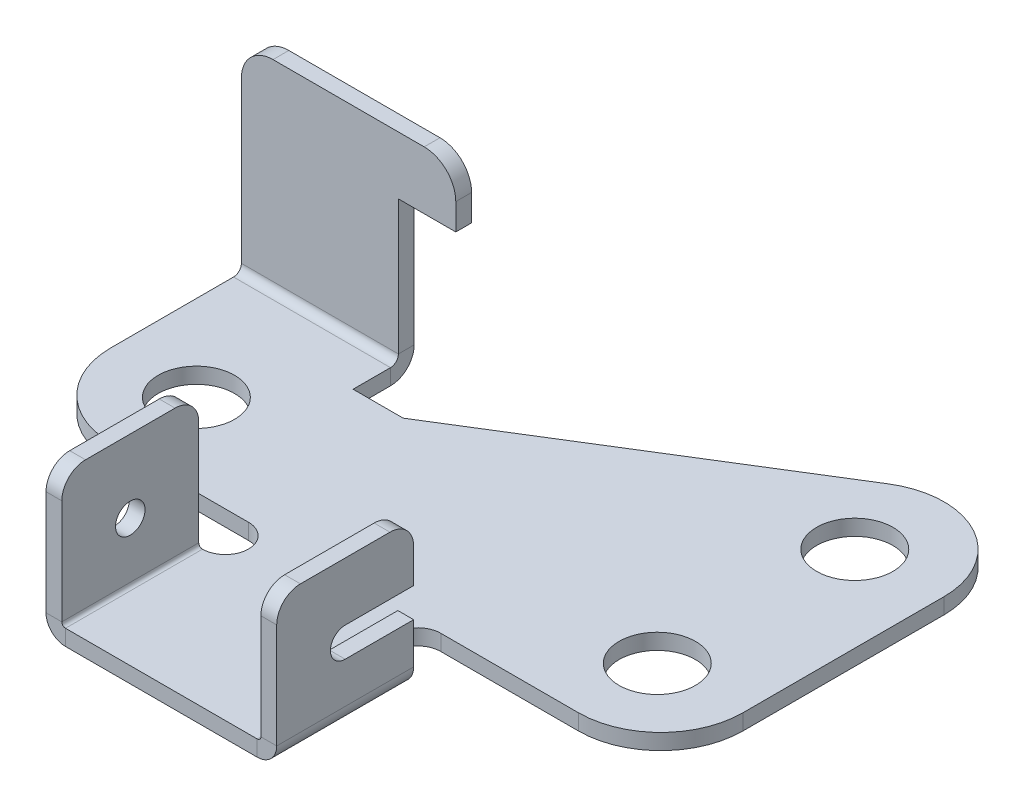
ISO-10303-21;
HEADER;
FILE_DESCRIPTION(('STEP AP214'),'2;1');
FILE_NAME('part.step','',(''),(''),'','','');
FILE_SCHEMA(('AUTOMOTIVE_DESIGN { 1 0 10303 214 1 1 1 1 }'));
ENDSEC;
DATA;
#1=APPLICATION_CONTEXT('core data for automotive mechanical design processes');
#2=APPLICATION_PROTOCOL_DEFINITION('international standard','automotive_design',2000,#1);
#3=PRODUCT_CONTEXT('',#1,'mechanical');
#4=PRODUCT('Part','Part','',(#3));
#5=PRODUCT_RELATED_PRODUCT_CATEGORY('part','',(#4));
#6=PRODUCT_DEFINITION_FORMATION('','',#4);
#7=PRODUCT_DEFINITION_CONTEXT('part definition',#1,'design');
#8=PRODUCT_DEFINITION('design','',#6,#7);
#9=PRODUCT_DEFINITION_SHAPE('','',#8);
#10=(LENGTH_UNIT() NAMED_UNIT(*) SI_UNIT(.MILLI.,.METRE.));
#11=(NAMED_UNIT(*) PLANE_ANGLE_UNIT() SI_UNIT($,.RADIAN.));
#12=(NAMED_UNIT(*) SI_UNIT($,.STERADIAN.) SOLID_ANGLE_UNIT());
#13=UNCERTAINTY_MEASURE_WITH_UNIT(LENGTH_MEASURE(1.E-05),#10,'distance_accuracy_value','');
#14=(GEOMETRIC_REPRESENTATION_CONTEXT(3) GLOBAL_UNCERTAINTY_ASSIGNED_CONTEXT((#13)) GLOBAL_UNIT_ASSIGNED_CONTEXT((#10,
#11,#12)) REPRESENTATION_CONTEXT('',''));
#15=CARTESIAN_POINT('',(0.,0.,0.));
#16=DIRECTION('',(0.,0.,1.));
#17=DIRECTION('',(1.,0.,0.));
#18=AXIS2_PLACEMENT_3D('',#15,#16,#17);
#19=CARTESIAN_POINT('',(11.2776,-0.762,-9.7028));
#20=DIRECTION('',(0.,1.,0.));
#21=DIRECTION('',(0.,0.,1.));
#22=AXIS2_PLACEMENT_3D('',#19,#20,#21);
#23=PLANE('',#22);
#24=CARTESIAN_POINT('',(11.1125,-0.762,0.));
#25=DIRECTION('',(0.,1.,0.));
#26=DIRECTION('',(0.,0.,1.));
#27=AXIS2_PLACEMENT_3D('',#24,#25,#26);
#28=CIRCLE('',#27,1.8415);
#29=CARTESIAN_POINT('',(11.1125,-0.762,1.8415));
#30=VERTEX_POINT('',#29);
#31=EDGE_CURVE('E623',#30,#30,#28,.T.);
#32=ORIENTED_EDGE('',*,*,#31,.T.);
#33=EDGE_LOOP('',(#32));
#34=FACE_BOUND('',#33,.T.);
#35=CARTESIAN_POINT('',(-11.1125,-0.762,0.));
#36=DIRECTION('',(0.,1.,0.));
#37=DIRECTION('',(0.,0.,1.));
#38=AXIS2_PLACEMENT_3D('',#35,#36,#37);
#39=CIRCLE('',#38,1.8415);
#40=CARTESIAN_POINT('',(-11.1125,-0.762,1.8415));
#41=VERTEX_POINT('',#40);
#42=EDGE_CURVE('E617',#41,#41,#39,.T.);
#43=ORIENTED_EDGE('',*,*,#42,.T.);
#44=EDGE_LOOP('',(#43));
#45=FACE_BOUND('',#44,.T.);
#46=CARTESIAN_POINT('',(11.1125,-0.762,-9.525));
#47=DIRECTION('',(0.,1.,0.));
#48=DIRECTION('',(0.,0.,1.));
#49=AXIS2_PLACEMENT_3D('',#46,#47,#48);
#50=CIRCLE('',#49,1.8415);
#51=CARTESIAN_POINT('',(11.1125,-0.762,-7.6835));
#52=VERTEX_POINT('',#51);
#53=EDGE_CURVE('E611',#52,#52,#50,.T.);
#54=ORIENTED_EDGE('',*,*,#53,.T.);
#55=EDGE_LOOP('',(#54));
#56=FACE_BOUND('',#55,.T.);
#57=DIRECTION('',(-1.,0.,0.));
#58=VECTOR('',#57,1.);
#59=CARTESIAN_POINT('',(-15.24,-0.762000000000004,-5.9182));
#60=LINE('',#59,#58);
#61=CARTESIAN_POINT('',(-15.24,-0.762000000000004,-5.9182));
#62=VERTEX_POINT('',#61);
#63=CARTESIAN_POINT('',(-7.6708,-0.761999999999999,-5.9182));
#64=VERTEX_POINT('',#63);
#65=EDGE_CURVE('E430',#62,#64,#60,.F.);
#66=ORIENTED_EDGE('',*,*,#65,.T.);
#67=DIRECTION('',(0.,0.,-1.));
#68=VECTOR('',#67,1.);
#69=CARTESIAN_POINT('',(-7.6708,-0.762,-7.0612));
#70=LINE('',#69,#68);
#71=CARTESIAN_POINT('',(-7.6708,-0.762,-4.1148));
#72=VERTEX_POINT('',#71);
#73=EDGE_CURVE('E664',#72,#64,#70,.T.);
#74=ORIENTED_EDGE('',*,*,#73,.F.);
#75=DIRECTION('',(-1.,0.,0.));
#76=VECTOR('',#75,1.);
#77=CARTESIAN_POINT('',(-5.2578,-0.762,-4.1148));
#78=LINE('',#77,#76);
#79=CARTESIAN_POINT('',(-5.2578,-0.762,-4.1148));
#80=VERTEX_POINT('',#79);
#81=EDGE_CURVE('E661',#80,#72,#78,.T.);
#82=ORIENTED_EDGE('',*,*,#81,.F.);
#83=DIRECTION('',(-0.849949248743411,0.,0.52686456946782));
#84=VECTOR('',#83,1.);
#85=CARTESIAN_POINT('',(-5.2578,-0.762,-4.1148));
#86=LINE('',#85,#84);
#87=CARTESIAN_POINT('',(9.18995182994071,-0.762,-13.0706389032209));
#88=VERTEX_POINT('',#87);
#89=EDGE_CURVE('E658',#88,#80,#86,.T.);
#90=ORIENTED_EDGE('',*,*,#89,.F.);
#91=CARTESIAN_POINT('',(11.2776,-0.762,-9.7028));
#92=DIRECTION('',(0.,1.,0.));
#93=DIRECTION('',(0.,0.,1.));
#94=AXIS2_PLACEMENT_3D('',#91,#92,#93);
#95=CIRCLE('',#94,3.9624);
#96=CARTESIAN_POINT('',(15.24,-0.762,-9.7028));
#97=VERTEX_POINT('',#96);
#98=EDGE_CURVE('E655',#97,#88,#95,.T.);
#99=ORIENTED_EDGE('',*,*,#98,.F.);
#100=DIRECTION('',(0.,0.,-1.));
#101=VECTOR('',#100,1.);
#102=CARTESIAN_POINT('',(15.24,-0.762,-9.7028));
#103=LINE('',#102,#101);
#104=CARTESIAN_POINT('',(15.24,-0.762,0.));
#105=VERTEX_POINT('',#104);
#106=EDGE_CURVE('E652',#105,#97,#103,.T.);
#107=ORIENTED_EDGE('',*,*,#106,.F.);
#108=CARTESIAN_POINT('',(11.2776,-0.762,0.));
#109=DIRECTION('',(0.,1.,0.));
#110=DIRECTION('',(0.,0.,-1.));
#111=AXIS2_PLACEMENT_3D('',#108,#109,#110);
#112=CIRCLE('',#111,3.9624);
#113=CARTESIAN_POINT('',(11.2776,-0.762,3.9624));
#114=VERTEX_POINT('',#113);
#115=EDGE_CURVE('E649',#114,#105,#112,.T.);
#116=ORIENTED_EDGE('',*,*,#115,.F.);
#117=DIRECTION('',(1.,0.,0.));
#118=VECTOR('',#117,1.);
#119=CARTESIAN_POINT('',(11.2776,-0.762,3.9624));
#120=LINE('',#119,#118);
#121=CARTESIAN_POINT('',(4.6355,-0.762,3.9624));
#122=VERTEX_POINT('',#121);
#123=EDGE_CURVE('E646',#122,#114,#120,.T.);
#124=ORIENTED_EDGE('',*,*,#123,.F.);
#125=CARTESIAN_POINT('',(4.6355,-0.762,5.07999999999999));
#126=DIRECTION('',(0.,-1.,0.));
#127=DIRECTION('',(0.,0.,1.));
#128=AXIS2_PLACEMENT_3D('',#125,#126,#127);
#129=CIRCLE('',#128,1.1176);
#130=CARTESIAN_POINT('',(4.0531965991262,-0.762,6.03391430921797));
#131=VERTEX_POINT('',#130);
#132=EDGE_CURVE('E644',#131,#122,#129,.T.);
#133=ORIENTED_EDGE('',*,*,#132,.F.);
#134=CARTESIAN_POINT('',(4.2418,-0.762,6.00709999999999));
#135=DIRECTION('',(0.,1.,0.));
#136=DIRECTION('',(0.,0.,1.));
#137=AXIS2_PLACEMENT_3D('',#134,#135,#136);
#138=CIRCLE('',#137,0.1905);
#139=CARTESIAN_POINT('',(4.2418,-0.762,6.19759999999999));
#140=VERTEX_POINT('',#139);
#141=EDGE_CURVE('E537',#140,#131,#138,.F.);
#142=ORIENTED_EDGE('',*,*,#141,.F.);
#143=DIRECTION('',(-1.,0.,0.));
#144=VECTOR('',#143,1.);
#145=CARTESIAN_POINT('',(11.2776,-0.762,6.19759999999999));
#146=LINE('',#145,#144);
#147=CARTESIAN_POINT('',(4.6228,-0.761999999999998,6.19759999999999));
#148=VERTEX_POINT('',#147);
#149=EDGE_CURVE('E543',#148,#140,#146,.T.);
#150=ORIENTED_EDGE('',*,*,#149,.F.);
#151=DIRECTION('',(0.,0.,-1.));
#152=VECTOR('',#151,1.);
#153=CARTESIAN_POINT('',(4.6228,-0.761999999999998,6.19759999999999));
#154=LINE('',#153,#152);
#155=CARTESIAN_POINT('',(4.6228,-0.762,12.8016));
#156=VERTEX_POINT('',#155);
#157=EDGE_CURVE('E512',#148,#156,#154,.F.);
#158=ORIENTED_EDGE('',*,*,#157,.T.);
#159=DIRECTION('',(1.,0.,0.));
#160=VECTOR('',#159,1.);
#161=CARTESIAN_POINT('',(-5.5626,-0.762,12.8016));
#162=LINE('',#161,#160);
#163=CARTESIAN_POINT('',(-4.6228,-0.761999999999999,12.8016));
#164=VERTEX_POINT('',#163);
#165=EDGE_CURVE('E641',#164,#156,#162,.T.);
#166=ORIENTED_EDGE('',*,*,#165,.F.);
#167=DIRECTION('',(0.,0.,1.));
#168=VECTOR('',#167,1.);
#169=CARTESIAN_POINT('',(-4.6228,-0.761999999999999,12.8016));
#170=LINE('',#169,#168);
#171=CARTESIAN_POINT('',(-4.6228,-0.762,6.19759999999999));
#172=VERTEX_POINT('',#171);
#173=EDGE_CURVE('E573',#164,#172,#170,.F.);
#174=ORIENTED_EDGE('',*,*,#173,.T.);
#175=DIRECTION('',(-1.,0.,0.));
#176=VECTOR('',#175,1.);
#177=CARTESIAN_POINT('',(11.2776,-0.762,6.19759999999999));
#178=LINE('',#177,#176);
#179=CARTESIAN_POINT('',(-4.5466,-0.762,6.19759999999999));
#180=VERTEX_POINT('',#179);
#181=EDGE_CURVE('E608',#180,#172,#178,.T.);
#182=ORIENTED_EDGE('',*,*,#181,.F.);
#183=DIRECTION('',(0.,0.,1.));
#184=VECTOR('',#183,1.);
#185=CARTESIAN_POINT('',(-4.5466,-0.762,-9.7028));
#186=LINE('',#185,#184);
#187=CARTESIAN_POINT('',(-4.5466,-0.762,6.19405859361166));
#188=VERTEX_POINT('',#187);
#189=EDGE_CURVE('E599',#188,#180,#186,.T.);
#190=ORIENTED_EDGE('',*,*,#189,.F.);
#191=CARTESIAN_POINT('',(-4.6355,-0.762,5.07999999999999));
#192=DIRECTION('',(0.,-1.,0.));
#193=DIRECTION('',(0.,0.,-1.));
#194=AXIS2_PLACEMENT_3D('',#191,#192,#193);
#195=CIRCLE('',#194,1.1176);
#196=CARTESIAN_POINT('',(-4.6355,-0.762,3.9624));
#197=VERTEX_POINT('',#196);
#198=EDGE_CURVE('E638',#197,#188,#195,.T.);
#199=ORIENTED_EDGE('',*,*,#198,.F.);
#200=DIRECTION('',(1.,0.,0.));
#201=VECTOR('',#200,1.);
#202=CARTESIAN_POINT('',(-11.2776,-0.762,3.9624));
#203=LINE('',#202,#201);
#204=CARTESIAN_POINT('',(-11.2776,-0.762,3.9624));
#205=VERTEX_POINT('',#204);
#206=EDGE_CURVE('E635',#205,#197,#203,.T.);
#207=ORIENTED_EDGE('',*,*,#206,.F.);
#208=CARTESIAN_POINT('',(-11.2776,-0.762,0.));
#209=DIRECTION('',(0.,1.,0.));
#210=DIRECTION('',(0.,0.,-1.));
#211=AXIS2_PLACEMENT_3D('',#208,#209,#210);
#212=CIRCLE('',#211,3.9624);
#213=CARTESIAN_POINT('',(-15.24,-0.762,0.));
#214=VERTEX_POINT('',#213);
#215=EDGE_CURVE('E631',#214,#205,#212,.T.);
#216=ORIENTED_EDGE('',*,*,#215,.F.);
#217=DIRECTION('',(0.,0.,1.));
#218=VECTOR('',#217,1.);
#219=CARTESIAN_POINT('',(-15.24,-0.762,-7.0612));
#220=LINE('',#219,#218);
#221=EDGE_CURVE('E629',#62,#214,#220,.T.);
#222=ORIENTED_EDGE('',*,*,#221,.F.);
#223=EDGE_LOOP('',(#66,#74,#82,#90,#99,#107,#116,#124,#133,#142,#150,#158,#166,#174,#182,#190,
#199,#207,#216,#222));
#224=FACE_BOUND('',#223,.T.);
#225=ADVANCED_FACE('F94',(#34,#45,#56,#224),#23,.F.);
#226=CARTESIAN_POINT('',(11.2776,0.,-9.7028));
#227=DIRECTION('',(0.,1.,0.));
#228=DIRECTION('',(0.,0.,1.));
#229=AXIS2_PLACEMENT_3D('',#226,#227,#228);
#230=PLANE('',#229);
#231=CARTESIAN_POINT('',(11.1125,0.,0.));
#232=DIRECTION('',(0.,1.,0.));
#233=DIRECTION('',(0.,0.,1.));
#234=AXIS2_PLACEMENT_3D('',#231,#232,#233);
#235=CIRCLE('',#234,1.8415);
#236=CARTESIAN_POINT('',(11.1125,0.,1.8415));
#237=VERTEX_POINT('',#236);
#238=EDGE_CURVE('E620',#237,#237,#235,.T.);
#239=ORIENTED_EDGE('',*,*,#238,.F.);
#240=EDGE_LOOP('',(#239));
#241=FACE_BOUND('',#240,.T.);
#242=CARTESIAN_POINT('',(-11.1125,0.,0.));
#243=DIRECTION('',(0.,1.,0.));
#244=DIRECTION('',(0.,0.,1.));
#245=AXIS2_PLACEMENT_3D('',#242,#243,#244);
#246=CIRCLE('',#245,1.8415);
#247=CARTESIAN_POINT('',(-11.1125,0.,1.8415));
#248=VERTEX_POINT('',#247);
#249=EDGE_CURVE('E614',#248,#248,#246,.T.);
#250=ORIENTED_EDGE('',*,*,#249,.F.);
#251=EDGE_LOOP('',(#250));
#252=FACE_BOUND('',#251,.T.);
#253=CARTESIAN_POINT('',(11.1125,0.,-9.525));
#254=DIRECTION('',(0.,1.,0.));
#255=DIRECTION('',(0.,0.,1.));
#256=AXIS2_PLACEMENT_3D('',#253,#254,#255);
#257=CIRCLE('',#256,1.8415);
#258=CARTESIAN_POINT('',(11.1125,0.,-7.6835));
#259=VERTEX_POINT('',#258);
#260=EDGE_CURVE('E610',#259,#259,#257,.T.);
#261=ORIENTED_EDGE('',*,*,#260,.F.);
#262=EDGE_LOOP('',(#261));
#263=FACE_BOUND('',#262,.T.);
#264=DIRECTION('',(0.,0.,-1.));
#265=VECTOR('',#264,1.);
#266=CARTESIAN_POINT('',(-7.6708,0.,-7.0612));
#267=LINE('',#266,#265);
#268=CARTESIAN_POINT('',(-7.6708,0.,-4.1148));
#269=VERTEX_POINT('',#268);
#270=CARTESIAN_POINT('',(-7.6708,0.,-5.9182));
#271=VERTEX_POINT('',#270);
#272=EDGE_CURVE('E632',#269,#271,#267,.T.);
#273=ORIENTED_EDGE('',*,*,#272,.T.);
#274=DIRECTION('',(-1.,0.,0.));
#275=VECTOR('',#274,1.);
#276=CARTESIAN_POINT('',(-15.24,0.,-5.9182));
#277=LINE('',#276,#275);
#278=CARTESIAN_POINT('',(-15.24,0.,-5.9182));
#279=VERTEX_POINT('',#278);
#280=EDGE_CURVE('E442',#279,#271,#277,.F.);
#281=ORIENTED_EDGE('',*,*,#280,.F.);
#282=DIRECTION('',(0.,0.,1.));
#283=VECTOR('',#282,1.);
#284=CARTESIAN_POINT('',(-15.24,0.,-7.0612));
#285=LINE('',#284,#283);
#286=CARTESIAN_POINT('',(-15.24,0.,0.));
#287=VERTEX_POINT('',#286);
#288=EDGE_CURVE('E626',#279,#287,#285,.T.);
#289=ORIENTED_EDGE('',*,*,#288,.T.);
#290=CARTESIAN_POINT('',(-11.2776,0.,0.));
#291=DIRECTION('',(0.,1.,0.));
#292=DIRECTION('',(0.,0.,-1.));
#293=AXIS2_PLACEMENT_3D('',#290,#291,#292);
#294=CIRCLE('',#293,3.9624);
#295=CARTESIAN_POINT('',(-11.2776,0.,3.9624));
#296=VERTEX_POINT('',#295);
#297=EDGE_CURVE('E669',#287,#296,#294,.T.);
#298=ORIENTED_EDGE('',*,*,#297,.T.);
#299=DIRECTION('',(1.,0.,0.));
#300=VECTOR('',#299,1.);
#301=CARTESIAN_POINT('',(-11.2776,0.,3.9624));
#302=LINE('',#301,#300);
#303=CARTESIAN_POINT('',(-4.6355,0.,3.9624));
#304=VERTEX_POINT('',#303);
#305=EDGE_CURVE('E672',#296,#304,#302,.T.);
#306=ORIENTED_EDGE('',*,*,#305,.T.);
#307=CARTESIAN_POINT('',(-4.6355,0.,5.07999999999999));
#308=DIRECTION('',(0.,-1.,0.));
#309=DIRECTION('',(0.,0.,-1.));
#310=AXIS2_PLACEMENT_3D('',#307,#308,#309);
#311=CIRCLE('',#310,1.1176);
#312=CARTESIAN_POINT('',(-4.5466,0.,6.19405859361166));
#313=VERTEX_POINT('',#312);
#314=EDGE_CURVE('E675',#304,#313,#311,.T.);
#315=ORIENTED_EDGE('',*,*,#314,.T.);
#316=DIRECTION('',(0.,0.,-1.));
#317=VECTOR('',#316,1.);
#318=CARTESIAN_POINT('',(-4.5466,0.,6.19759999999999));
#319=LINE('',#318,#317);
#320=CARTESIAN_POINT('',(-4.5466,0.,6.19759999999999));
#321=VERTEX_POINT('',#320);
#322=EDGE_CURVE('E600',#321,#313,#319,.T.);
#323=ORIENTED_EDGE('',*,*,#322,.F.);
#324=DIRECTION('',(1.,0.,0.));
#325=VECTOR('',#324,1.);
#326=CARTESIAN_POINT('',(-4.6228,0.,6.19759999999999));
#327=LINE('',#326,#325);
#328=CARTESIAN_POINT('',(-4.6228,0.,6.19759999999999));
#329=VERTEX_POINT('',#328);
#330=EDGE_CURVE('E597',#329,#321,#327,.T.);
#331=ORIENTED_EDGE('',*,*,#330,.F.);
#332=DIRECTION('',(0.,0.,1.));
#333=VECTOR('',#332,1.);
#334=CARTESIAN_POINT('',(-4.6228,0.,12.8016));
#335=LINE('',#334,#333);
#336=CARTESIAN_POINT('',(-4.6228,0.,12.8016));
#337=VERTEX_POINT('',#336);
#338=EDGE_CURVE('E586',#337,#329,#335,.F.);
#339=ORIENTED_EDGE('',*,*,#338,.F.);
#340=DIRECTION('',(1.,0.,0.));
#341=VECTOR('',#340,1.);
#342=CARTESIAN_POINT('',(-5.5626,0.,12.8016));
#343=LINE('',#342,#341);
#344=CARTESIAN_POINT('',(4.6228,0.,12.8016));
#345=VERTEX_POINT('',#344);
#346=EDGE_CURVE('E678',#337,#345,#343,.T.);
#347=ORIENTED_EDGE('',*,*,#346,.T.);
#348=DIRECTION('',(0.,0.,-1.));
#349=VECTOR('',#348,1.);
#350=CARTESIAN_POINT('',(4.6228,0.,6.19759999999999));
#351=LINE('',#350,#349);
#352=CARTESIAN_POINT('',(4.6228,0.,6.19759999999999));
#353=VERTEX_POINT('',#352);
#354=EDGE_CURVE('E524',#353,#345,#351,.F.);
#355=ORIENTED_EDGE('',*,*,#354,.F.);
#356=DIRECTION('',(1.,0.,0.));
#357=VECTOR('',#356,1.);
#358=CARTESIAN_POINT('',(4.2418,0.,6.19759999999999));
#359=LINE('',#358,#357);
#360=CARTESIAN_POINT('',(4.2418,0.,6.19759999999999));
#361=VERTEX_POINT('',#360);
#362=EDGE_CURVE('E538',#361,#353,#359,.T.);
#363=ORIENTED_EDGE('',*,*,#362,.F.);
#364=CARTESIAN_POINT('',(4.2418,0.,6.00709999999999));
#365=DIRECTION('',(0.,1.,0.));
#366=DIRECTION('',(0.,0.,1.));
#367=AXIS2_PLACEMENT_3D('',#364,#365,#366);
#368=CIRCLE('',#367,0.1905);
#369=CARTESIAN_POINT('',(4.0531965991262,0.,6.03391430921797));
#370=VERTEX_POINT('',#369);
#371=EDGE_CURVE('E535',#370,#361,#368,.T.);
#372=ORIENTED_EDGE('',*,*,#371,.F.);
#373=CARTESIAN_POINT('',(4.6355,0.,5.07999999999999));
#374=DIRECTION('',(0.,-1.,0.));
#375=DIRECTION('',(0.,0.,1.));
#376=AXIS2_PLACEMENT_3D('',#373,#374,#375);
#377=CIRCLE('',#376,1.1176);
#378=CARTESIAN_POINT('',(4.6355,0.,3.9624));
#379=VERTEX_POINT('',#378);
#380=EDGE_CURVE('E681',#370,#379,#377,.T.);
#381=ORIENTED_EDGE('',*,*,#380,.T.);
#382=DIRECTION('',(1.,0.,0.));
#383=VECTOR('',#382,1.);
#384=CARTESIAN_POINT('',(11.2776,0.,3.9624));
#385=LINE('',#384,#383);
#386=CARTESIAN_POINT('',(11.2776,0.,3.9624));
#387=VERTEX_POINT('',#386);
#388=EDGE_CURVE('E683',#379,#387,#385,.T.);
#389=ORIENTED_EDGE('',*,*,#388,.T.);
#390=CARTESIAN_POINT('',(11.2776,0.,0.));
#391=DIRECTION('',(0.,1.,0.));
#392=DIRECTION('',(0.,0.,-1.));
#393=AXIS2_PLACEMENT_3D('',#390,#391,#392);
#394=CIRCLE('',#393,3.9624);
#395=CARTESIAN_POINT('',(15.24,0.,0.));
#396=VERTEX_POINT('',#395);
#397=EDGE_CURVE('E686',#387,#396,#394,.T.);
#398=ORIENTED_EDGE('',*,*,#397,.T.);
#399=DIRECTION('',(0.,0.,-1.));
#400=VECTOR('',#399,1.);
#401=CARTESIAN_POINT('',(15.24,0.,-9.7028));
#402=LINE('',#401,#400);
#403=CARTESIAN_POINT('',(15.24,0.,-9.7028));
#404=VERTEX_POINT('',#403);
#405=EDGE_CURVE('E689',#396,#404,#402,.T.);
#406=ORIENTED_EDGE('',*,*,#405,.T.);
#407=CARTESIAN_POINT('',(11.2776,0.,-9.7028));
#408=DIRECTION('',(0.,1.,0.));
#409=DIRECTION('',(0.,0.,1.));
#410=AXIS2_PLACEMENT_3D('',#407,#408,#409);
#411=CIRCLE('',#410,3.9624);
#412=CARTESIAN_POINT('',(9.18995182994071,0.,-13.0706389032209));
#413=VERTEX_POINT('',#412);
#414=EDGE_CURVE('E692',#404,#413,#411,.T.);
#415=ORIENTED_EDGE('',*,*,#414,.T.);
#416=DIRECTION('',(-0.849949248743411,0.,0.52686456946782));
#417=VECTOR('',#416,1.);
#418=CARTESIAN_POINT('',(-5.2578,0.,-4.1148));
#419=LINE('',#418,#417);
#420=CARTESIAN_POINT('',(-5.2578,0.,-4.1148));
#421=VERTEX_POINT('',#420);
#422=EDGE_CURVE('E695',#413,#421,#419,.T.);
#423=ORIENTED_EDGE('',*,*,#422,.T.);
#424=DIRECTION('',(-1.,0.,0.));
#425=VECTOR('',#424,1.);
#426=CARTESIAN_POINT('',(-5.2578,0.,-4.1148));
#427=LINE('',#426,#425);
#428=EDGE_CURVE('E698',#421,#269,#427,.T.);
#429=ORIENTED_EDGE('',*,*,#428,.T.);
#430=EDGE_LOOP('',(#273,#281,#289,#298,#306,#315,#323,#331,#339,#347,#355,#363,#372,#381,#389,
#398,#406,#415,#423,#429));
#431=FACE_BOUND('',#430,.T.);
#432=ADVANCED_FACE('F811',(#241,#252,#263,#431),#230,.T.);
#433=CARTESIAN_POINT('',(-15.24,-0.762,-7.0612));
#434=DIRECTION('',(-1.,0.,0.));
#435=DIRECTION('',(0.,0.,1.));
#436=AXIS2_PLACEMENT_3D('',#433,#434,#435);
#437=PLANE('',#436);
#438=ORIENTED_EDGE('',*,*,#288,.F.);
#439=DIRECTION('',(0.,-1.,0.));
#440=VECTOR('',#439,1.);
#441=CARTESIAN_POINT('',(-15.24,0.,-5.9182));
#442=LINE('',#441,#440);
#443=EDGE_CURVE('E436',#279,#62,#442,.T.);
#444=ORIENTED_EDGE('',*,*,#443,.T.);
#445=ORIENTED_EDGE('',*,*,#221,.T.);
#446=DIRECTION('',(0.,1.,0.));
#447=VECTOR('',#446,1.);
#448=CARTESIAN_POINT('',(-15.24,-0.762,0.));
#449=LINE('',#448,#447);
#450=EDGE_CURVE('E667',#214,#287,#449,.T.);
#451=ORIENTED_EDGE('',*,*,#450,.T.);
#452=EDGE_LOOP('',(#438,#444,#445,#451));
#453=FACE_BOUND('',#452,.T.);
#454=ADVANCED_FACE('F817',(#453),#437,.T.);
#455=CARTESIAN_POINT('',(5.56260000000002,6.3754,6.19759999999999));
#456=DIRECTION('',(0.,0.,1.));
#457=DIRECTION('',(1.,0.,0.));
#458=AXIS2_PLACEMENT_3D('',#455,#456,#457);
#459=PLANE('',#458);
#460=DIRECTION('',(1.,0.,0.));
#461=VECTOR('',#460,1.);
#462=CARTESIAN_POINT('',(5.56260000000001,3.57180499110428,6.19759999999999));
#463=LINE('',#462,#461);
#464=CARTESIAN_POINT('',(5.56260000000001,3.57180499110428,6.19759999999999));
#465=VERTEX_POINT('',#464);
#466=CARTESIAN_POINT('',(4.80060000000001,3.57180499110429,6.19759999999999));
#467=VERTEX_POINT('',#466);
#468=EDGE_CURVE('E468',#465,#467,#463,.F.);
#469=ORIENTED_EDGE('',*,*,#468,.T.);
#470=DIRECTION('',(0.,-1.,0.));
#471=VECTOR('',#470,1.);
#472=CARTESIAN_POINT('',(4.80060000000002,6.3754,6.19759999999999));
#473=LINE('',#472,#471);
#474=CARTESIAN_POINT('',(4.80060000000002,5.2324,6.19759999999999));
#475=VERTEX_POINT('',#474);
#476=EDGE_CURVE('E499',#467,#475,#473,.F.);
#477=ORIENTED_EDGE('',*,*,#476,.T.);
#478=DIRECTION('',(-1.,0.,0.));
#479=VECTOR('',#478,1.);
#480=CARTESIAN_POINT('',(5.56260000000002,5.2324,6.19759999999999));
#481=LINE('',#480,#479);
#482=CARTESIAN_POINT('',(5.56260000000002,5.2324,6.19759999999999));
#483=VERTEX_POINT('',#482);
#484=EDGE_CURVE('E759',#475,#483,#481,.F.);
#485=ORIENTED_EDGE('',*,*,#484,.T.);
#486=DIRECTION('',(0.,1.,0.));
#487=VECTOR('',#486,1.);
#488=CARTESIAN_POINT('',(5.5626,0.,6.19759999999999));
#489=LINE('',#488,#487);
#490=EDGE_CURVE('E490',#465,#483,#489,.T.);
#491=ORIENTED_EDGE('',*,*,#490,.F.);
#492=EDGE_LOOP('',(#469,#477,#485,#491));
#493=FACE_BOUND('',#492,.T.);
#494=ADVANCED_FACE('F876',(#493),#459,.F.);
#495=DIRECTION('',(1.,0.,0.));
#496=VECTOR('',#495,1.);
#497=CARTESIAN_POINT('',(5.56260000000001,2.14940499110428,6.19759999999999));
#498=LINE('',#497,#496);
#499=CARTESIAN_POINT('',(5.56260000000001,2.14940499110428,6.19759999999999));
#500=VERTEX_POINT('',#499);
#501=CARTESIAN_POINT('',(4.80060000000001,2.14940499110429,6.19759999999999));
#502=VERTEX_POINT('',#501);
#503=EDGE_CURVE('E460',#500,#502,#498,.F.);
#504=ORIENTED_EDGE('',*,*,#503,.F.);
#505=CARTESIAN_POINT('',(5.5626,0.177799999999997,6.19759999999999));
#506=VERTEX_POINT('',#505);
#507=EDGE_CURVE('E487',#506,#500,#489,.T.);
#508=ORIENTED_EDGE('',*,*,#507,.F.);
#509=DIRECTION('',(-1.,0.,0.));
#510=VECTOR('',#509,1.);
#511=CARTESIAN_POINT('',(4.8006,0.1778,6.19759999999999));
#512=LINE('',#511,#510);
#513=CARTESIAN_POINT('',(4.8006,0.1778,6.19759999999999));
#514=VERTEX_POINT('',#513);
#515=EDGE_CURVE('E505',#514,#506,#512,.F.);
#516=ORIENTED_EDGE('',*,*,#515,.F.);
#517=EDGE_CURVE('E496',#514,#502,#473,.F.);
#518=ORIENTED_EDGE('',*,*,#517,.T.);
#519=EDGE_LOOP('',(#504,#508,#516,#518));
#520=FACE_BOUND('',#519,.T.);
#521=ADVANCED_FACE('F1018',(#520),#459,.F.);
#522=CARTESIAN_POINT('',(5.5626,0.,0.));
#523=DIRECTION('',(-1.,0.,0.));
#524=DIRECTION('',(0.,-1.,0.));
#525=AXIS2_PLACEMENT_3D('',#522,#523,#524);
#526=PLANE('',#525);
#527=DIRECTION('',(0.,0.,1.));
#528=VECTOR('',#527,1.);
#529=CARTESIAN_POINT('',(5.56260000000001,3.57180499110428,9.49959999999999));
#530=LINE('',#529,#528);
#531=CARTESIAN_POINT('',(5.56260000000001,3.57180499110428,9.49959999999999));
#532=VERTEX_POINT('',#531);
#533=EDGE_CURVE('E457',#465,#532,#530,.T.);
#534=ORIENTED_EDGE('',*,*,#533,.F.);
#535=ORIENTED_EDGE('',*,*,#490,.T.);
#536=CARTESIAN_POINT('',(5.56260000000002,5.2324,7.34059999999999));
#537=DIRECTION('',(-1.,0.,0.));
#538=DIRECTION('',(0.,-1.,0.));
#539=AXIS2_PLACEMENT_3D('',#536,#537,#538);
#540=CIRCLE('',#539,1.143);
#541=CARTESIAN_POINT('',(5.56260000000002,6.3754,7.34059999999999));
#542=VERTEX_POINT('',#541);
#543=EDGE_CURVE('E755',#483,#542,#540,.F.);
#544=ORIENTED_EDGE('',*,*,#543,.T.);
#545=DIRECTION('',(0.,0.,1.));
#546=VECTOR('',#545,1.);
#547=CARTESIAN_POINT('',(5.56260000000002,6.3754,0.));
#548=LINE('',#547,#546);
#549=CARTESIAN_POINT('',(5.56260000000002,6.3754,11.6586));
#550=VERTEX_POINT('',#549);
#551=EDGE_CURVE('E483',#542,#550,#548,.T.);
#552=ORIENTED_EDGE('',*,*,#551,.T.);
#553=CARTESIAN_POINT('',(5.56260000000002,5.2324,11.6586));
#554=DIRECTION('',(-1.,0.,0.));
#555=DIRECTION('',(0.,-1.,0.));
#556=AXIS2_PLACEMENT_3D('',#553,#554,#555);
#557=CIRCLE('',#556,1.143);
#558=CARTESIAN_POINT('',(5.56260000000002,5.2324,12.8016));
#559=VERTEX_POINT('',#558);
#560=EDGE_CURVE('E757',#550,#559,#557,.F.);
#561=ORIENTED_EDGE('',*,*,#560,.T.);
#562=DIRECTION('',(0.,-1.,0.));
#563=VECTOR('',#562,1.);
#564=CARTESIAN_POINT('',(5.5626,0.,12.8016));
#565=LINE('',#564,#563);
#566=CARTESIAN_POINT('',(5.5626,0.177799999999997,12.8016));
#567=VERTEX_POINT('',#566);
#568=EDGE_CURVE('E491',#559,#567,#565,.T.);
#569=ORIENTED_EDGE('',*,*,#568,.T.);
#570=DIRECTION('',(0.,0.,-1.));
#571=VECTOR('',#570,1.);
#572=CARTESIAN_POINT('',(5.5626,0.177799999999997,12.8016));
#573=LINE('',#572,#571);
#574=EDGE_CURVE('E502',#506,#567,#573,.F.);
#575=ORIENTED_EDGE('',*,*,#574,.F.);
#576=ORIENTED_EDGE('',*,*,#507,.T.);
#577=DIRECTION('',(0.,0.,-1.));
#578=VECTOR('',#577,1.);
#579=CARTESIAN_POINT('',(5.56260000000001,2.14940499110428,9.49959999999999));
#580=LINE('',#579,#578);
#581=CARTESIAN_POINT('',(5.56260000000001,2.14940499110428,9.49959999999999));
#582=VERTEX_POINT('',#581);
#583=EDGE_CURVE('E450',#582,#500,#580,.T.);
#584=ORIENTED_EDGE('',*,*,#583,.F.);
#585=CARTESIAN_POINT('',(5.56260000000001,2.86060499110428,9.49959999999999));
#586=DIRECTION('',(-1.,0.,0.));
#587=DIRECTION('',(0.,-1.,0.));
#588=AXIS2_PLACEMENT_3D('',#585,#586,#587);
#589=CIRCLE('',#588,0.711200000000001);
#590=EDGE_CURVE('E476',#582,#532,#589,.T.);
#591=ORIENTED_EDGE('',*,*,#590,.T.);
#592=EDGE_LOOP('',(#534,#535,#544,#552,#561,#569,#575,#576,#584,#591));
#593=FACE_BOUND('',#592,.T.);
#594=ADVANCED_FACE('F1015',(#593),#526,.F.);
#595=CARTESIAN_POINT('',(4.8006,0.,0.));
#596=DIRECTION('',(-1.,0.,0.));
#597=DIRECTION('',(0.,-1.,0.));
#598=AXIS2_PLACEMENT_3D('',#595,#596,#597);
#599=PLANE('',#598);
#600=ORIENTED_EDGE('',*,*,#476,.F.);
#601=DIRECTION('',(0.,0.,1.));
#602=VECTOR('',#601,1.);
#603=CARTESIAN_POINT('',(4.80060000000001,3.57180499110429,0.));
#604=LINE('',#603,#602);
#605=CARTESIAN_POINT('',(4.80060000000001,3.57180499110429,9.49959999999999));
#606=VERTEX_POINT('',#605);
#607=EDGE_CURVE('E456',#467,#606,#604,.T.);
#608=ORIENTED_EDGE('',*,*,#607,.T.);
#609=CARTESIAN_POINT('',(4.80060000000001,2.86060499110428,9.49959999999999));
#610=DIRECTION('',(-1.,0.,0.));
#611=DIRECTION('',(0.,-1.,0.));
#612=AXIS2_PLACEMENT_3D('',#609,#610,#611);
#613=CIRCLE('',#612,0.711200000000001);
#614=CARTESIAN_POINT('',(4.80060000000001,2.14940499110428,9.49959999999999));
#615=VERTEX_POINT('',#614);
#616=EDGE_CURVE('E475',#615,#606,#613,.T.);
#617=ORIENTED_EDGE('',*,*,#616,.F.);
#618=DIRECTION('',(0.,0.,1.));
#619=VECTOR('',#618,1.);
#620=CARTESIAN_POINT('',(4.80060000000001,2.14940499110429,0.));
#621=LINE('',#620,#619);
#622=EDGE_CURVE('E453',#615,#502,#621,.F.);
#623=ORIENTED_EDGE('',*,*,#622,.T.);
#624=ORIENTED_EDGE('',*,*,#517,.F.);
#625=DIRECTION('',(0.,0.,-1.));
#626=VECTOR('',#625,1.);
#627=CARTESIAN_POINT('',(4.8006,0.1778,12.8016));
#628=LINE('',#627,#626);
#629=CARTESIAN_POINT('',(4.8006,0.1778,12.8016));
#630=VERTEX_POINT('',#629);
#631=EDGE_CURVE('E508',#630,#514,#628,.T.);
#632=ORIENTED_EDGE('',*,*,#631,.F.);
#633=DIRECTION('',(0.,1.,0.));
#634=VECTOR('',#633,1.);
#635=CARTESIAN_POINT('',(4.8006,0.,12.8016));
#636=LINE('',#635,#634);
#637=CARTESIAN_POINT('',(4.80060000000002,5.2324,12.8016));
#638=VERTEX_POINT('',#637);
#639=EDGE_CURVE('E500',#638,#630,#636,.F.);
#640=ORIENTED_EDGE('',*,*,#639,.F.);
#641=CARTESIAN_POINT('',(4.80060000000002,5.2324,11.6586));
#642=DIRECTION('',(-1.,0.,0.));
#643=DIRECTION('',(0.,-1.,0.));
#644=AXIS2_PLACEMENT_3D('',#641,#642,#643);
#645=CIRCLE('',#644,1.143);
#646=CARTESIAN_POINT('',(4.80060000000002,6.3754,11.6586));
#647=VERTEX_POINT('',#646);
#648=EDGE_CURVE('E748',#638,#647,#645,.T.);
#649=ORIENTED_EDGE('',*,*,#648,.T.);
#650=DIRECTION('',(0.,0.,-1.));
#651=VECTOR('',#650,1.);
#652=CARTESIAN_POINT('',(4.80060000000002,6.3754,12.8016));
#653=LINE('',#652,#651);
#654=CARTESIAN_POINT('',(4.80060000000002,6.3754,7.34059999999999));
#655=VERTEX_POINT('',#654);
#656=EDGE_CURVE('E493',#655,#647,#653,.F.);
#657=ORIENTED_EDGE('',*,*,#656,.F.);
#658=CARTESIAN_POINT('',(4.80060000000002,5.2324,7.34059999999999));
#659=DIRECTION('',(-1.,0.,0.));
#660=DIRECTION('',(0.,-1.,0.));
#661=AXIS2_PLACEMENT_3D('',#658,#659,#660);
#662=CIRCLE('',#661,1.143);
#663=EDGE_CURVE('E745',#655,#475,#662,.T.);
#664=ORIENTED_EDGE('',*,*,#663,.T.);
#665=EDGE_LOOP('',(#600,#608,#617,#623,#624,#632,#640,#649,#657,#664));
#666=FACE_BOUND('',#665,.T.);
#667=ADVANCED_FACE('F859',(#666),#599,.T.);
#668=CARTESIAN_POINT('',(4.6355,-0.762,5.07999999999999));
#669=DIRECTION('',(0.,1.,0.));
#670=DIRECTION('',(0.,0.,1.));
#671=AXIS2_PLACEMENT_3D('',#668,#669,#670);
#672=CYLINDRICAL_SURFACE('',#671,1.1176);
#673=ORIENTED_EDGE('',*,*,#380,.F.);
#674=DIRECTION('',(0.,-1.,0.));
#675=VECTOR('',#674,1.);
#676=CARTESIAN_POINT('',(4.0531965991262,-0.381499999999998,6.03391430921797));
#677=LINE('',#676,#675);
#678=EDGE_CURVE('E705',#370,#131,#677,.T.);
#679=ORIENTED_EDGE('',*,*,#678,.T.);
#680=ORIENTED_EDGE('',*,*,#132,.T.);
#681=DIRECTION('',(0.,1.,0.));
#682=VECTOR('',#681,1.);
#683=CARTESIAN_POINT('',(4.6355,-0.762,3.9624));
#684=LINE('',#683,#682);
#685=EDGE_CURVE('E716',#122,#379,#684,.T.);
#686=ORIENTED_EDGE('',*,*,#685,.T.);
#687=EDGE_LOOP('',(#673,#679,#680,#686));
#688=FACE_BOUND('',#687,.T.);
#689=ADVANCED_FACE('F855',(#688),#672,.F.);
#690=CARTESIAN_POINT('',(-5.5626,-0.762,12.8016));
#691=DIRECTION('',(0.,0.,1.));
#692=DIRECTION('',(1.,0.,0.));
#693=AXIS2_PLACEMENT_3D('',#690,#691,#692);
#694=PLANE('',#693);
#695=DIRECTION('',(0.,-1.,0.));
#696=VECTOR('',#695,1.);
#697=CARTESIAN_POINT('',(4.6228,0.,12.8016));
#698=LINE('',#697,#696);
#699=EDGE_CURVE('E529',#345,#156,#698,.T.);
#700=ORIENTED_EDGE('',*,*,#699,.F.);
#701=ORIENTED_EDGE('',*,*,#346,.F.);
#702=DIRECTION('',(0.,-1.,0.));
#703=VECTOR('',#702,1.);
#704=CARTESIAN_POINT('',(-4.6228,0.,12.8016));
#705=LINE('',#704,#703);
#706=EDGE_CURVE('E580',#337,#164,#705,.T.);
#707=ORIENTED_EDGE('',*,*,#706,.T.);
#708=ORIENTED_EDGE('',*,*,#165,.T.);
#709=EDGE_LOOP('',(#700,#701,#707,#708));
#710=FACE_BOUND('',#709,.T.);
#711=ADVANCED_FACE('F858',(#710),#694,.T.);
#712=CARTESIAN_POINT('',(-4.6355,-0.762,5.07999999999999));
#713=DIRECTION('',(0.,1.,0.));
#714=DIRECTION('',(0.,0.,1.));
#715=AXIS2_PLACEMENT_3D('',#712,#713,#714);
#716=CYLINDRICAL_SURFACE('',#715,1.1176);
#717=ORIENTED_EDGE('',*,*,#198,.T.);
#718=DIRECTION('',(0.,1.,0.));
#719=VECTOR('',#718,1.);
#720=CARTESIAN_POINT('',(-4.5466,-0.762,6.19405859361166));
#721=LINE('',#720,#719);
#722=EDGE_CURVE('E605',#188,#313,#721,.T.);
#723=ORIENTED_EDGE('',*,*,#722,.T.);
#724=ORIENTED_EDGE('',*,*,#314,.F.);
#725=DIRECTION('',(0.,1.,0.));
#726=VECTOR('',#725,1.);
#727=CARTESIAN_POINT('',(-4.6355,-0.762,3.9624));
#728=LINE('',#727,#726);
#729=EDGE_CURVE('E719',#197,#304,#728,.T.);
#730=ORIENTED_EDGE('',*,*,#729,.F.);
#731=EDGE_LOOP('',(#717,#723,#724,#730));
#732=FACE_BOUND('',#731,.T.);
#733=ADVANCED_FACE('F829',(#732),#716,.F.);
#734=CARTESIAN_POINT('',(-7.6708,-0.762,-7.0612));
#735=DIRECTION('',(1.,0.,0.));
#736=DIRECTION('',(0.,0.,-1.));
#737=AXIS2_PLACEMENT_3D('',#734,#735,#736);
#738=PLANE('',#737);
#739=DIRECTION('',(0.,-1.,0.));
#740=VECTOR('',#739,1.);
#741=CARTESIAN_POINT('',(-7.6708,0.,-5.9182));
#742=LINE('',#741,#740);
#743=EDGE_CURVE('E447',#271,#64,#742,.T.);
#744=ORIENTED_EDGE('',*,*,#743,.F.);
#745=ORIENTED_EDGE('',*,*,#272,.F.);
#746=DIRECTION('',(0.,1.,0.));
#747=VECTOR('',#746,1.);
#748=CARTESIAN_POINT('',(-7.6708,-0.762,-4.1148));
#749=LINE('',#748,#747);
#750=EDGE_CURVE('E703',#72,#269,#749,.T.);
#751=ORIENTED_EDGE('',*,*,#750,.F.);
#752=ORIENTED_EDGE('',*,*,#73,.T.);
#753=EDGE_LOOP('',(#744,#745,#751,#752));
#754=FACE_BOUND('',#753,.T.);
#755=ADVANCED_FACE('F825',(#754),#738,.T.);
#756=CARTESIAN_POINT('',(-5.2578,-0.762,-4.1148));
#757=DIRECTION('',(0.,0.,-1.));
#758=DIRECTION('',(-1.,0.,0.));
#759=AXIS2_PLACEMENT_3D('',#756,#757,#758);
#760=PLANE('',#759);
#761=ORIENTED_EDGE('',*,*,#428,.F.);
#762=DIRECTION('',(0.,1.,0.));
#763=VECTOR('',#762,1.);
#764=CARTESIAN_POINT('',(-5.2578,-0.762,-4.1148));
#765=LINE('',#764,#763);
#766=EDGE_CURVE('E706',#80,#421,#765,.T.);
#767=ORIENTED_EDGE('',*,*,#766,.F.);
#768=ORIENTED_EDGE('',*,*,#81,.T.);
#769=ORIENTED_EDGE('',*,*,#750,.T.);
#770=EDGE_LOOP('',(#761,#767,#768,#769));
#771=FACE_BOUND('',#770,.T.);
#772=ADVANCED_FACE('F828',(#771),#760,.T.);
#773=CARTESIAN_POINT('',(-5.2578,-0.762,-4.1148));
#774=DIRECTION('',(-0.52686456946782,0.,-0.849949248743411));
#775=DIRECTION('',(-0.849949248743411,0.,0.52686456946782));
#776=AXIS2_PLACEMENT_3D('',#773,#774,#775);
#777=PLANE('',#776);
#778=ORIENTED_EDGE('',*,*,#422,.F.);
#779=DIRECTION('',(0.,1.,0.));
#780=VECTOR('',#779,1.);
#781=CARTESIAN_POINT('',(9.18995182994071,-0.762,-13.0706389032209));
#782=LINE('',#781,#780);
#783=EDGE_CURVE('E708',#88,#413,#782,.T.);
#784=ORIENTED_EDGE('',*,*,#783,.F.);
#785=ORIENTED_EDGE('',*,*,#89,.T.);
#786=ORIENTED_EDGE('',*,*,#766,.T.);
#787=EDGE_LOOP('',(#778,#784,#785,#786));
#788=FACE_BOUND('',#787,.T.);
#789=ADVANCED_FACE('F833',(#788),#777,.T.);
#790=CARTESIAN_POINT('',(11.2776,-0.762,-9.7028));
#791=DIRECTION('',(0.,1.,0.));
#792=DIRECTION('',(0.,0.,1.));
#793=AXIS2_PLACEMENT_3D('',#790,#791,#792);
#794=CYLINDRICAL_SURFACE('',#793,3.9624);
#795=ORIENTED_EDGE('',*,*,#414,.F.);
#796=DIRECTION('',(0.,1.,0.));
#797=VECTOR('',#796,1.);
#798=CARTESIAN_POINT('',(15.24,-0.762,-9.7028));
#799=LINE('',#798,#797);
#800=EDGE_CURVE('E710',#97,#404,#799,.T.);
#801=ORIENTED_EDGE('',*,*,#800,.F.);
#802=ORIENTED_EDGE('',*,*,#98,.T.);
#803=ORIENTED_EDGE('',*,*,#783,.T.);
#804=EDGE_LOOP('',(#795,#801,#802,#803));
#805=FACE_BOUND('',#804,.T.);
#806=ADVANCED_FACE('F837',(#805),#794,.T.);
#807=CARTESIAN_POINT('',(15.24,-0.762,-9.7028));
#808=DIRECTION('',(1.,0.,0.));
#809=DIRECTION('',(0.,0.,-1.));
#810=AXIS2_PLACEMENT_3D('',#807,#808,#809);
#811=PLANE('',#810);
#812=ORIENTED_EDGE('',*,*,#405,.F.);
#813=DIRECTION('',(0.,1.,0.));
#814=VECTOR('',#813,1.);
#815=CARTESIAN_POINT('',(15.24,-0.762,0.));
#816=LINE('',#815,#814);
#817=EDGE_CURVE('E712',#105,#396,#816,.T.);
#818=ORIENTED_EDGE('',*,*,#817,.F.);
#819=ORIENTED_EDGE('',*,*,#106,.T.);
#820=ORIENTED_EDGE('',*,*,#800,.T.);
#821=EDGE_LOOP('',(#812,#818,#819,#820));
#822=FACE_BOUND('',#821,.T.);
#823=ADVANCED_FACE('F841',(#822),#811,.T.);
#824=CARTESIAN_POINT('',(11.2776,-0.762,0.));
#825=DIRECTION('',(0.,1.,0.));
#826=DIRECTION('',(0.,0.,1.));
#827=AXIS2_PLACEMENT_3D('',#824,#825,#826);
#828=CYLINDRICAL_SURFACE('',#827,3.9624);
#829=ORIENTED_EDGE('',*,*,#397,.F.);
#830=DIRECTION('',(0.,1.,0.));
#831=VECTOR('',#830,1.);
#832=CARTESIAN_POINT('',(11.2776,-0.762,3.9624));
#833=LINE('',#832,#831);
#834=EDGE_CURVE('E714',#114,#387,#833,.T.);
#835=ORIENTED_EDGE('',*,*,#834,.F.);
#836=ORIENTED_EDGE('',*,*,#115,.T.);
#837=ORIENTED_EDGE('',*,*,#817,.T.);
#838=EDGE_LOOP('',(#829,#835,#836,#837));
#839=FACE_BOUND('',#838,.T.);
#840=ADVANCED_FACE('F845',(#839),#828,.T.);
#841=CARTESIAN_POINT('',(11.2776,-0.762,3.9624));
#842=DIRECTION('',(0.,0.,1.));
#843=DIRECTION('',(1.,0.,0.));
#844=AXIS2_PLACEMENT_3D('',#841,#842,#843);
#845=PLANE('',#844);
#846=ORIENTED_EDGE('',*,*,#388,.F.);
#847=ORIENTED_EDGE('',*,*,#685,.F.);
#848=ORIENTED_EDGE('',*,*,#123,.T.);
#849=ORIENTED_EDGE('',*,*,#834,.T.);
#850=EDGE_LOOP('',(#846,#847,#848,#849));
#851=FACE_BOUND('',#850,.T.);
#852=ADVANCED_FACE('F849',(#851),#845,.T.);
#853=CARTESIAN_POINT('',(-11.2776,-0.762,3.9624));
#854=DIRECTION('',(0.,0.,1.));
#855=DIRECTION('',(1.,0.,0.));
#856=AXIS2_PLACEMENT_3D('',#853,#854,#855);
#857=PLANE('',#856);
#858=ORIENTED_EDGE('',*,*,#305,.F.);
#859=DIRECTION('',(0.,1.,0.));
#860=VECTOR('',#859,1.);
#861=CARTESIAN_POINT('',(-11.2776,-0.762,3.9624));
#862=LINE('',#861,#860);
#863=EDGE_CURVE('E721',#205,#296,#862,.T.);
#864=ORIENTED_EDGE('',*,*,#863,.F.);
#865=ORIENTED_EDGE('',*,*,#206,.T.);
#866=ORIENTED_EDGE('',*,*,#729,.T.);
#867=EDGE_LOOP('',(#858,#864,#865,#866));
#868=FACE_BOUND('',#867,.T.);
#869=ADVANCED_FACE('F853',(#868),#857,.T.);
#870=CARTESIAN_POINT('',(-11.2776,-0.762,0.));
#871=DIRECTION('',(0.,1.,0.));
#872=DIRECTION('',(0.,0.,1.));
#873=AXIS2_PLACEMENT_3D('',#870,#871,#872);
#874=CYLINDRICAL_SURFACE('',#873,3.9624);
#875=ORIENTED_EDGE('',*,*,#297,.F.);
#876=ORIENTED_EDGE('',*,*,#450,.F.);
#877=ORIENTED_EDGE('',*,*,#215,.T.);
#878=ORIENTED_EDGE('',*,*,#863,.T.);
#879=EDGE_LOOP('',(#875,#876,#877,#878));
#880=FACE_BOUND('',#879,.T.);
#881=ADVANCED_FACE('F869',(#880),#874,.T.);
#882=CARTESIAN_POINT('',(11.1125,-0.762,0.));
#883=DIRECTION('',(0.,1.,0.));
#884=DIRECTION('',(0.,0.,1.));
#885=AXIS2_PLACEMENT_3D('',#882,#883,#884);
#886=CYLINDRICAL_SURFACE('',#885,1.8415);
#887=CARTESIAN_POINT('',(11.1125,-0.762,1.8415));
#888=CARTESIAN_POINT('',(11.1125,-0.7540625,1.8415));
#889=CARTESIAN_POINT('',(11.1125,-0.746125,1.8415));
#890=CARTESIAN_POINT('',(11.1125,-0.73025,1.8415));
#891=CARTESIAN_POINT('',(11.1125,-0.7223125,1.8415));
#892=CARTESIAN_POINT('',(11.1125,-0.7064375,1.8415));
#893=CARTESIAN_POINT('',(11.1125,-0.6985,1.8415));
#894=CARTESIAN_POINT('',(11.1125,-0.682625,1.8415));
#895=CARTESIAN_POINT('',(11.1125,-0.6746875,1.8415));
#896=CARTESIAN_POINT('',(11.1125,-0.6588125,1.8415));
#897=CARTESIAN_POINT('',(11.1125,-0.650875,1.8415));
#898=CARTESIAN_POINT('',(11.1125,-0.635,1.8415));
#899=CARTESIAN_POINT('',(11.1125,-0.6270625,1.8415));
#900=CARTESIAN_POINT('',(11.1125,-0.6111875,1.8415));
#901=CARTESIAN_POINT('',(11.1125,-0.60325,1.8415));
#902=CARTESIAN_POINT('',(11.1125,-0.587375,1.8415));
#903=CARTESIAN_POINT('',(11.1125,-0.5794375,1.8415));
#904=CARTESIAN_POINT('',(11.1125,-0.5635625,1.8415));
#905=CARTESIAN_POINT('',(11.1125,-0.555625,1.8415));
#906=CARTESIAN_POINT('',(11.1125,-0.53975,1.8415));
#907=CARTESIAN_POINT('',(11.1125,-0.5318125,1.8415));
#908=CARTESIAN_POINT('',(11.1125,-0.5159375,1.8415));
#909=CARTESIAN_POINT('',(11.1125,-0.508,1.8415));
#910=CARTESIAN_POINT('',(11.1125,-0.492125,1.8415));
#911=CARTESIAN_POINT('',(11.1125,-0.4841875,1.8415));
#912=CARTESIAN_POINT('',(11.1125,-0.4683125,1.8415));
#913=CARTESIAN_POINT('',(11.1125,-0.460375,1.8415));
#914=CARTESIAN_POINT('',(11.1125,-0.4445,1.8415));
#915=CARTESIAN_POINT('',(11.1125,-0.4365625,1.8415));
#916=CARTESIAN_POINT('',(11.1125,-0.4206875,1.8415));
#917=CARTESIAN_POINT('',(11.1125,-0.41275,1.8415));
#918=CARTESIAN_POINT('',(11.1125,-0.396875,1.8415));
#919=CARTESIAN_POINT('',(11.1125,-0.3889375,1.8415));
#920=CARTESIAN_POINT('',(11.1125,-0.3730625,1.8415));
#921=CARTESIAN_POINT('',(11.1125,-0.365125,1.8415));
#922=CARTESIAN_POINT('',(11.1125,-0.34925,1.8415));
#923=CARTESIAN_POINT('',(11.1125,-0.3413125,1.8415));
#924=CARTESIAN_POINT('',(11.1125,-0.3254375,1.8415));
#925=CARTESIAN_POINT('',(11.1125,-0.3175,1.8415));
#926=CARTESIAN_POINT('',(11.1125,-0.301625,1.8415));
#927=CARTESIAN_POINT('',(11.1125,-0.2936875,1.8415));
#928=CARTESIAN_POINT('',(11.1125,-0.2778125,1.8415));
#929=CARTESIAN_POINT('',(11.1125,-0.269875,1.8415));
#930=CARTESIAN_POINT('',(11.1125,-0.254,1.8415));
#931=CARTESIAN_POINT('',(11.1125,-0.2460625,1.8415));
#932=CARTESIAN_POINT('',(11.1125,-0.2301875,1.8415));
#933=CARTESIAN_POINT('',(11.1125,-0.22225,1.8415));
#934=CARTESIAN_POINT('',(11.1125,-0.206375,1.8415));
#935=CARTESIAN_POINT('',(11.1125,-0.1984375,1.8415));
#936=CARTESIAN_POINT('',(11.1125,-0.1825625,1.8415));
#937=CARTESIAN_POINT('',(11.1125,-0.174625,1.8415));
#938=CARTESIAN_POINT('',(11.1125,-0.15875,1.8415));
#939=CARTESIAN_POINT('',(11.1125,-0.1508125,1.8415));
#940=CARTESIAN_POINT('',(11.1125,-0.1349375,1.8415));
#941=CARTESIAN_POINT('',(11.1125,-0.127,1.8415));
#942=CARTESIAN_POINT('',(11.1125,-0.111125,1.8415));
#943=CARTESIAN_POINT('',(11.1125,-0.1031875,1.8415));
#944=CARTESIAN_POINT('',(11.1125,-0.0873125,1.8415));
#945=CARTESIAN_POINT('',(11.1125,-0.079375,1.8415));
#946=CARTESIAN_POINT('',(11.1125,-0.0635,1.8415));
#947=CARTESIAN_POINT('',(11.1125,-0.0555625,1.8415));
#948=CARTESIAN_POINT('',(11.1125,-0.0396875,1.8415));
#949=CARTESIAN_POINT('',(11.1125,-0.03175,1.8415));
#950=CARTESIAN_POINT('',(11.1125,-0.015875,1.8415));
#951=CARTESIAN_POINT('',(11.1125,-0.00793749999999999,1.8415));
#952=CARTESIAN_POINT('',(11.1125,0.,1.8415));
#953=B_SPLINE_CURVE_WITH_KNOTS('',3,(#887,#888,#889,#890,#891,#892,#893,#894,#895,#896,#897,
#898,#899,#900,#901,#902,#903,#904,#905,#906,#907,#908,#909,#910,#911,#912,#913,#914,#915,#916,
#917,#918,#919,#920,#921,#922,#923,#924,#925,#926,#927,#928,#929,#930,#931,#932,#933,#934,#935,
#936,#937,#938,#939,#940,#941,#942,#943,#944,#945,#946,#947,#948,#949,#950,#951,#952),
.UNSPECIFIED.,.F.,.F.,(4,2,2,2,2,2,2,2,2,2,2,2,2,2,2,2,2,2,2,2,2,2,2,2,2,2,2,2,2,2,2,2,4),(0.,
0.0238125,0.0476249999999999,0.0714375,0.09525,0.1190625,0.142875,0.1666875,0.1905,0.2143125,
0.238125,0.2619375,0.28575,0.3095625,0.333375,0.3571875,0.381,0.4048125,0.428625,0.4524375,
0.47625,0.5000625,0.523875,0.5476875,0.5715,0.5953125,0.619125,0.6429375,0.66675,0.6905625,
0.714375,0.7381875,0.762),.UNSPECIFIED.);
#954=EDGE_CURVE('BSEAM822',#30,#237,#953,.T.);
#955=ORIENTED_EDGE('',*,*,#31,.F.);
#956=ORIENTED_EDGE('',*,*,#238,.T.);
#957=ORIENTED_EDGE('',*,*,#954,.T.);
#958=ORIENTED_EDGE('',*,*,#954,.F.);
#959=EDGE_LOOP('',(#955,#957,#956,#958));
#960=FACE_BOUND('',#959,.T.);
#961=ADVANCED_FACE('F822',(#960),#886,.F.);
#962=CARTESIAN_POINT('',(-11.1125,-0.762,0.));
#963=DIRECTION('',(0.,1.,0.));
#964=DIRECTION('',(0.,0.,1.));
#965=AXIS2_PLACEMENT_3D('',#962,#963,#964);
#966=CYLINDRICAL_SURFACE('',#965,1.8415);
#967=CARTESIAN_POINT('',(-11.1125,-0.762,1.8415));
#968=CARTESIAN_POINT('',(-11.1125,-0.7540625,1.8415));
#969=CARTESIAN_POINT('',(-11.1125,-0.746125,1.8415));
#970=CARTESIAN_POINT('',(-11.1125,-0.73025,1.8415));
#971=CARTESIAN_POINT('',(-11.1125,-0.7223125,1.8415));
#972=CARTESIAN_POINT('',(-11.1125,-0.7064375,1.8415));
#973=CARTESIAN_POINT('',(-11.1125,-0.6985,1.8415));
#974=CARTESIAN_POINT('',(-11.1125,-0.682625,1.8415));
#975=CARTESIAN_POINT('',(-11.1125,-0.6746875,1.8415));
#976=CARTESIAN_POINT('',(-11.1125,-0.6588125,1.8415));
#977=CARTESIAN_POINT('',(-11.1125,-0.650875,1.8415));
#978=CARTESIAN_POINT('',(-11.1125,-0.635,1.8415));
#979=CARTESIAN_POINT('',(-11.1125,-0.6270625,1.8415));
#980=CARTESIAN_POINT('',(-11.1125,-0.6111875,1.8415));
#981=CARTESIAN_POINT('',(-11.1125,-0.60325,1.8415));
#982=CARTESIAN_POINT('',(-11.1125,-0.587375,1.8415));
#983=CARTESIAN_POINT('',(-11.1125,-0.5794375,1.8415));
#984=CARTESIAN_POINT('',(-11.1125,-0.5635625,1.8415));
#985=CARTESIAN_POINT('',(-11.1125,-0.555625,1.8415));
#986=CARTESIAN_POINT('',(-11.1125,-0.53975,1.8415));
#987=CARTESIAN_POINT('',(-11.1125,-0.5318125,1.8415));
#988=CARTESIAN_POINT('',(-11.1125,-0.5159375,1.8415));
#989=CARTESIAN_POINT('',(-11.1125,-0.508,1.8415));
#990=CARTESIAN_POINT('',(-11.1125,-0.492125,1.8415));
#991=CARTESIAN_POINT('',(-11.1125,-0.4841875,1.8415));
#992=CARTESIAN_POINT('',(-11.1125,-0.4683125,1.8415));
#993=CARTESIAN_POINT('',(-11.1125,-0.460375,1.8415));
#994=CARTESIAN_POINT('',(-11.1125,-0.4445,1.8415));
#995=CARTESIAN_POINT('',(-11.1125,-0.4365625,1.8415));
#996=CARTESIAN_POINT('',(-11.1125,-0.4206875,1.8415));
#997=CARTESIAN_POINT('',(-11.1125,-0.41275,1.8415));
#998=CARTESIAN_POINT('',(-11.1125,-0.396875,1.8415));
#999=CARTESIAN_POINT('',(-11.1125,-0.3889375,1.8415));
#1000=CARTESIAN_POINT('',(-11.1125,-0.3730625,1.8415));
#1001=CARTESIAN_POINT('',(-11.1125,-0.365125,1.8415));
#1002=CARTESIAN_POINT('',(-11.1125,-0.34925,1.8415));
#1003=CARTESIAN_POINT('',(-11.1125,-0.3413125,1.8415));
#1004=CARTESIAN_POINT('',(-11.1125,-0.3254375,1.8415));
#1005=CARTESIAN_POINT('',(-11.1125,-0.3175,1.8415));
#1006=CARTESIAN_POINT('',(-11.1125,-0.301625,1.8415));
#1007=CARTESIAN_POINT('',(-11.1125,-0.2936875,1.8415));
#1008=CARTESIAN_POINT('',(-11.1125,-0.2778125,1.8415));
#1009=CARTESIAN_POINT('',(-11.1125,-0.269875,1.8415));
#1010=CARTESIAN_POINT('',(-11.1125,-0.254,1.8415));
#1011=CARTESIAN_POINT('',(-11.1125,-0.2460625,1.8415));
#1012=CARTESIAN_POINT('',(-11.1125,-0.2301875,1.8415));
#1013=CARTESIAN_POINT('',(-11.1125,-0.22225,1.8415));
#1014=CARTESIAN_POINT('',(-11.1125,-0.206375,1.8415));
#1015=CARTESIAN_POINT('',(-11.1125,-0.1984375,1.8415));
#1016=CARTESIAN_POINT('',(-11.1125,-0.1825625,1.8415));
#1017=CARTESIAN_POINT('',(-11.1125,-0.174625,1.8415));
#1018=CARTESIAN_POINT('',(-11.1125,-0.15875,1.8415));
#1019=CARTESIAN_POINT('',(-11.1125,-0.1508125,1.8415));
#1020=CARTESIAN_POINT('',(-11.1125,-0.1349375,1.8415));
#1021=CARTESIAN_POINT('',(-11.1125,-0.127,1.8415));
#1022=CARTESIAN_POINT('',(-11.1125,-0.111125,1.8415));
#1023=CARTESIAN_POINT('',(-11.1125,-0.1031875,1.8415));
#1024=CARTESIAN_POINT('',(-11.1125,-0.0873125,1.8415));
#1025=CARTESIAN_POINT('',(-11.1125,-0.079375,1.8415));
#1026=CARTESIAN_POINT('',(-11.1125,-0.0635,1.8415));
#1027=CARTESIAN_POINT('',(-11.1125,-0.0555625,1.8415));
#1028=CARTESIAN_POINT('',(-11.1125,-0.0396875,1.8415));
#1029=CARTESIAN_POINT('',(-11.1125,-0.03175,1.8415));
#1030=CARTESIAN_POINT('',(-11.1125,-0.015875,1.8415));
#1031=CARTESIAN_POINT('',(-11.1125,-0.00793749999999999,1.8415));
#1032=CARTESIAN_POINT('',(-11.1125,0.,1.8415));
#1033=B_SPLINE_CURVE_WITH_KNOTS('',3,(#967,#968,#969,#970,#971,#972,#973,#974,#975,#976,#977,
#978,#979,#980,#981,#982,#983,#984,#985,#986,#987,#988,#989,#990,#991,#992,#993,#994,#995,#996,
#997,#998,#999,#1000,#1001,#1002,#1003,#1004,#1005,#1006,#1007,#1008,#1009,#1010,#1011,#1012,
#1013,#1014,#1015,#1016,#1017,#1018,#1019,#1020,#1021,#1022,#1023,#1024,#1025,#1026,#1027,#1028,
#1029,#1030,#1031,#1032),.UNSPECIFIED.,.F.,.F.,(4,2,2,2,2,2,2,2,2,2,2,2,2,2,2,2,2,2,2,2,2,2,2,2,
2,2,2,2,2,2,2,2,4),(0.,0.0238125,0.0476249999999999,0.0714375,0.09525,0.1190625,0.142875,
0.1666875,0.1905,0.2143125,0.238125,0.2619375,0.28575,0.3095625,0.333375,0.3571875,0.381,
0.4048125,0.428625,0.4524375,0.47625,0.5000625,0.523875,0.5476875,0.5715,0.5953125,0.619125,
0.6429375,0.66675,0.6905625,0.714375,0.7381875,0.762),.UNSPECIFIED.);
#1034=EDGE_CURVE('BSEAM974',#41,#248,#1033,.T.);
#1035=ORIENTED_EDGE('',*,*,#42,.F.);
#1036=ORIENTED_EDGE('',*,*,#249,.T.);
#1037=ORIENTED_EDGE('',*,*,#1034,.T.);
#1038=ORIENTED_EDGE('',*,*,#1034,.F.);
#1039=EDGE_LOOP('',(#1035,#1037,#1036,#1038));
#1040=FACE_BOUND('',#1039,.T.);
#1041=ADVANCED_FACE('F974',(#1040),#966,.F.);
#1042=CARTESIAN_POINT('',(11.1125,-0.762,-9.525));
#1043=DIRECTION('',(0.,1.,0.));
#1044=DIRECTION('',(0.,0.,1.));
#1045=AXIS2_PLACEMENT_3D('',#1042,#1043,#1044);
#1046=CYLINDRICAL_SURFACE('',#1045,1.8415);
#1047=CARTESIAN_POINT('',(11.1125,-0.762,-7.6835));
#1048=CARTESIAN_POINT('',(11.1125,-0.7540625,-7.6835));
#1049=CARTESIAN_POINT('',(11.1125,-0.746125,-7.6835));
#1050=CARTESIAN_POINT('',(11.1125,-0.73025,-7.6835));
#1051=CARTESIAN_POINT('',(11.1125,-0.7223125,-7.6835));
#1052=CARTESIAN_POINT('',(11.1125,-0.7064375,-7.6835));
#1053=CARTESIAN_POINT('',(11.1125,-0.6985,-7.6835));
#1054=CARTESIAN_POINT('',(11.1125,-0.682625,-7.6835));
#1055=CARTESIAN_POINT('',(11.1125,-0.6746875,-7.6835));
#1056=CARTESIAN_POINT('',(11.1125,-0.6588125,-7.6835));
#1057=CARTESIAN_POINT('',(11.1125,-0.650875,-7.6835));
#1058=CARTESIAN_POINT('',(11.1125,-0.635,-7.6835));
#1059=CARTESIAN_POINT('',(11.1125,-0.6270625,-7.6835));
#1060=CARTESIAN_POINT('',(11.1125,-0.6111875,-7.6835));
#1061=CARTESIAN_POINT('',(11.1125,-0.60325,-7.6835));
#1062=CARTESIAN_POINT('',(11.1125,-0.587375,-7.6835));
#1063=CARTESIAN_POINT('',(11.1125,-0.5794375,-7.6835));
#1064=CARTESIAN_POINT('',(11.1125,-0.5635625,-7.6835));
#1065=CARTESIAN_POINT('',(11.1125,-0.555625,-7.6835));
#1066=CARTESIAN_POINT('',(11.1125,-0.53975,-7.6835));
#1067=CARTESIAN_POINT('',(11.1125,-0.5318125,-7.6835));
#1068=CARTESIAN_POINT('',(11.1125,-0.5159375,-7.6835));
#1069=CARTESIAN_POINT('',(11.1125,-0.508,-7.6835));
#1070=CARTESIAN_POINT('',(11.1125,-0.492125,-7.6835));
#1071=CARTESIAN_POINT('',(11.1125,-0.4841875,-7.6835));
#1072=CARTESIAN_POINT('',(11.1125,-0.4683125,-7.6835));
#1073=CARTESIAN_POINT('',(11.1125,-0.460375,-7.6835));
#1074=CARTESIAN_POINT('',(11.1125,-0.4445,-7.6835));
#1075=CARTESIAN_POINT('',(11.1125,-0.4365625,-7.6835));
#1076=CARTESIAN_POINT('',(11.1125,-0.4206875,-7.6835));
#1077=CARTESIAN_POINT('',(11.1125,-0.41275,-7.6835));
#1078=CARTESIAN_POINT('',(11.1125,-0.396875,-7.6835));
#1079=CARTESIAN_POINT('',(11.1125,-0.3889375,-7.6835));
#1080=CARTESIAN_POINT('',(11.1125,-0.3730625,-7.6835));
#1081=CARTESIAN_POINT('',(11.1125,-0.365125,-7.6835));
#1082=CARTESIAN_POINT('',(11.1125,-0.34925,-7.6835));
#1083=CARTESIAN_POINT('',(11.1125,-0.3413125,-7.6835));
#1084=CARTESIAN_POINT('',(11.1125,-0.3254375,-7.6835));
#1085=CARTESIAN_POINT('',(11.1125,-0.3175,-7.6835));
#1086=CARTESIAN_POINT('',(11.1125,-0.301625,-7.6835));
#1087=CARTESIAN_POINT('',(11.1125,-0.2936875,-7.6835));
#1088=CARTESIAN_POINT('',(11.1125,-0.2778125,-7.6835));
#1089=CARTESIAN_POINT('',(11.1125,-0.269875,-7.6835));
#1090=CARTESIAN_POINT('',(11.1125,-0.254,-7.6835));
#1091=CARTESIAN_POINT('',(11.1125,-0.2460625,-7.6835));
#1092=CARTESIAN_POINT('',(11.1125,-0.2301875,-7.6835));
#1093=CARTESIAN_POINT('',(11.1125,-0.22225,-7.6835));
#1094=CARTESIAN_POINT('',(11.1125,-0.206375,-7.6835));
#1095=CARTESIAN_POINT('',(11.1125,-0.1984375,-7.6835));
#1096=CARTESIAN_POINT('',(11.1125,-0.1825625,-7.6835));
#1097=CARTESIAN_POINT('',(11.1125,-0.174625,-7.6835));
#1098=CARTESIAN_POINT('',(11.1125,-0.15875,-7.6835));
#1099=CARTESIAN_POINT('',(11.1125,-0.1508125,-7.6835));
#1100=CARTESIAN_POINT('',(11.1125,-0.1349375,-7.6835));
#1101=CARTESIAN_POINT('',(11.1125,-0.127,-7.6835));
#1102=CARTESIAN_POINT('',(11.1125,-0.111125,-7.6835));
#1103=CARTESIAN_POINT('',(11.1125,-0.1031875,-7.6835));
#1104=CARTESIAN_POINT('',(11.1125,-0.0873125,-7.6835));
#1105=CARTESIAN_POINT('',(11.1125,-0.079375,-7.6835));
#1106=CARTESIAN_POINT('',(11.1125,-0.0635,-7.6835));
#1107=CARTESIAN_POINT('',(11.1125,-0.0555625,-7.6835));
#1108=CARTESIAN_POINT('',(11.1125,-0.0396875,-7.6835));
#1109=CARTESIAN_POINT('',(11.1125,-0.03175,-7.6835));
#1110=CARTESIAN_POINT('',(11.1125,-0.015875,-7.6835));
#1111=CARTESIAN_POINT('',(11.1125,-0.00793749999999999,-7.6835));
#1112=CARTESIAN_POINT('',(11.1125,0.,-7.6835));
#1113=B_SPLINE_CURVE_WITH_KNOTS('',3,(#1047,#1048,#1049,#1050,#1051,#1052,#1053,#1054,#1055,
#1056,#1057,#1058,#1059,#1060,#1061,#1062,#1063,#1064,#1065,#1066,#1067,#1068,#1069,#1070,#1071,
#1072,#1073,#1074,#1075,#1076,#1077,#1078,#1079,#1080,#1081,#1082,#1083,#1084,#1085,#1086,#1087,
#1088,#1089,#1090,#1091,#1092,#1093,#1094,#1095,#1096,#1097,#1098,#1099,#1100,#1101,#1102,#1103,
#1104,#1105,#1106,#1107,#1108,#1109,#1110,#1111,#1112),.UNSPECIFIED.,.F.,.F.,(4,2,2,2,2,2,2,2,2,
2,2,2,2,2,2,2,2,2,2,2,2,2,2,2,2,2,2,2,2,2,2,2,4),(0.,0.0238125,0.0476249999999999,0.0714375,
0.09525,0.1190625,0.142875,0.1666875,0.1905,0.2143125,0.238125,0.2619375,0.28575,0.3095625,
0.333375,0.3571875,0.381,0.4048125,0.428625,0.4524375,0.47625,0.5000625,0.523875,0.5476875,
0.5715,0.5953125,0.619125,0.6429375,0.66675,0.6905625,0.714375,0.7381875,0.762),.UNSPECIFIED.);
#1114=EDGE_CURVE('BSEAM971',#52,#259,#1113,.T.);
#1115=ORIENTED_EDGE('',*,*,#53,.F.);
#1116=ORIENTED_EDGE('',*,*,#260,.T.);
#1117=ORIENTED_EDGE('',*,*,#1114,.T.);
#1118=ORIENTED_EDGE('',*,*,#1114,.F.);
#1119=EDGE_LOOP('',(#1115,#1117,#1116,#1118));
#1120=FACE_BOUND('',#1119,.T.);
#1121=ADVANCED_FACE('F971',(#1120),#1046,.F.);
#1122=CARTESIAN_POINT('',(-4.6228,0.,6.19759999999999));
#1123=DIRECTION('',(0.,0.,-1.));
#1124=DIRECTION('',(0.,1.,0.));
#1125=AXIS2_PLACEMENT_3D('',#1122,#1123,#1124);
#1126=PLANE('',#1125);
#1127=DIRECTION('',(0.,-1.,0.));
#1128=VECTOR('',#1127,1.);
#1129=CARTESIAN_POINT('',(-4.5466,0.,6.19759999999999));
#1130=LINE('',#1129,#1128);
#1131=EDGE_CURVE('E594',#321,#180,#1130,.T.);
#1132=ORIENTED_EDGE('',*,*,#1131,.T.);
#1133=ORIENTED_EDGE('',*,*,#181,.T.);
#1134=DIRECTION('',(0.,-1.,0.));
#1135=VECTOR('',#1134,1.);
#1136=CARTESIAN_POINT('',(-4.6228,0.,6.19759999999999));
#1137=LINE('',#1136,#1135);
#1138=EDGE_CURVE('E591',#329,#172,#1137,.T.);
#1139=ORIENTED_EDGE('',*,*,#1138,.F.);
#1140=ORIENTED_EDGE('',*,*,#330,.T.);
#1141=EDGE_LOOP('',(#1132,#1133,#1139,#1140));
#1142=FACE_BOUND('',#1141,.T.);
#1143=ADVANCED_FACE('F967',(#1142),#1126,.T.);
#1144=CARTESIAN_POINT('',(-4.5466,0.,6.19759999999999));
#1145=DIRECTION('',(-1.,0.,0.));
#1146=DIRECTION('',(0.,0.,1.));
#1147=AXIS2_PLACEMENT_3D('',#1144,#1145,#1146);
#1148=PLANE('',#1147);
#1149=ORIENTED_EDGE('',*,*,#722,.F.);
#1150=ORIENTED_EDGE('',*,*,#189,.T.);
#1151=ORIENTED_EDGE('',*,*,#1131,.F.);
#1152=ORIENTED_EDGE('',*,*,#322,.T.);
#1153=EDGE_LOOP('',(#1149,#1150,#1151,#1152));
#1154=FACE_BOUND('',#1153,.T.);
#1155=ADVANCED_FACE('F961',(#1154),#1148,.T.);
#1156=CARTESIAN_POINT('',(-4.6228,0.1778,6.19759999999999));
#1157=DIRECTION('',(0.,0.,-1.));
#1158=DIRECTION('',(-1.,0.,0.));
#1159=AXIS2_PLACEMENT_3D('',#1156,#1157,#1158);
#1160=PLANE('',#1159);
#1161=DIRECTION('',(1.,0.,0.));
#1162=VECTOR('',#1161,1.);
#1163=CARTESIAN_POINT('',(-5.5626,0.177799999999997,6.19759999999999));
#1164=LINE('',#1163,#1162);
#1165=CARTESIAN_POINT('',(-4.8006,0.1778,6.19759999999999));
#1166=VERTEX_POINT('',#1165);
#1167=CARTESIAN_POINT('',(-5.5626,0.177799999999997,6.19759999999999));
#1168=VERTEX_POINT('',#1167);
#1169=EDGE_CURVE('E545',#1166,#1168,#1164,.F.);
#1170=ORIENTED_EDGE('',*,*,#1169,.F.);
#1171=CARTESIAN_POINT('',(-4.6228,0.1778,6.19759999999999));
#1172=DIRECTION('',(0.,0.,1.));
#1173=DIRECTION('',(1.,0.,0.));
#1174=AXIS2_PLACEMENT_3D('',#1171,#1172,#1173);
#1175=CIRCLE('',#1174,0.1778);
#1176=EDGE_CURVE('E583',#329,#1166,#1175,.F.);
#1177=ORIENTED_EDGE('',*,*,#1176,.F.);
#1178=ORIENTED_EDGE('',*,*,#1138,.T.);
#1179=CARTESIAN_POINT('',(-4.6228,0.1778,6.19759999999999));
#1180=DIRECTION('',(0.,0.,1.));
#1181=DIRECTION('',(1.,0.,0.));
#1182=AXIS2_PLACEMENT_3D('',#1179,#1180,#1181);
#1183=CIRCLE('',#1182,0.9398);
#1184=EDGE_CURVE('E576',#172,#1168,#1183,.F.);
#1185=ORIENTED_EDGE('',*,*,#1184,.T.);
#1186=EDGE_LOOP('',(#1170,#1177,#1178,#1185));
#1187=FACE_BOUND('',#1186,.T.);
#1188=ADVANCED_FACE('F915',(#1187),#1160,.T.);
#1189=CARTESIAN_POINT('',(-4.6228,0.1778,12.8016));
#1190=DIRECTION('',(0.,0.,-1.));
#1191=DIRECTION('',(-1.,0.,0.));
#1192=AXIS2_PLACEMENT_3D('',#1189,#1190,#1191);
#1193=PLANE('',#1192);
#1194=CARTESIAN_POINT('',(-4.6228,0.1778,12.8016));
#1195=DIRECTION('',(0.,0.,1.));
#1196=DIRECTION('',(1.,0.,0.));
#1197=AXIS2_PLACEMENT_3D('',#1194,#1195,#1196);
#1198=CIRCLE('',#1197,0.1778);
#1199=CARTESIAN_POINT('',(-4.8006,0.1778,12.8016));
#1200=VERTEX_POINT('',#1199);
#1201=EDGE_CURVE('E549',#1200,#337,#1198,.T.);
#1202=ORIENTED_EDGE('',*,*,#1201,.F.);
#1203=DIRECTION('',(1.,0.,0.));
#1204=VECTOR('',#1203,1.);
#1205=CARTESIAN_POINT('',(-4.8006,0.1778,12.8016));
#1206=LINE('',#1205,#1204);
#1207=CARTESIAN_POINT('',(-5.5626,0.177799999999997,12.8016));
#1208=VERTEX_POINT('',#1207);
#1209=EDGE_CURVE('E566',#1200,#1208,#1206,.F.);
#1210=ORIENTED_EDGE('',*,*,#1209,.T.);
#1211=CARTESIAN_POINT('',(-4.6228,0.1778,12.8016));
#1212=DIRECTION('',(0.,0.,1.));
#1213=DIRECTION('',(1.,0.,0.));
#1214=AXIS2_PLACEMENT_3D('',#1211,#1212,#1213);
#1215=CIRCLE('',#1214,0.9398);
#1216=EDGE_CURVE('E577',#1208,#164,#1215,.T.);
#1217=ORIENTED_EDGE('',*,*,#1216,.T.);
#1218=ORIENTED_EDGE('',*,*,#706,.F.);
#1219=EDGE_LOOP('',(#1202,#1210,#1217,#1218));
#1220=FACE_BOUND('',#1219,.T.);
#1221=ADVANCED_FACE('F955',(#1220),#1193,.F.);
#1222=CARTESIAN_POINT('',(-4.6228,0.1778,12.8016));
#1223=DIRECTION('',(0.,0.,1.));
#1224=DIRECTION('',(-1.,0.,0.));
#1225=AXIS2_PLACEMENT_3D('',#1222,#1223,#1224);
#1226=CYLINDRICAL_SURFACE('',#1225,0.9398);
#1227=ORIENTED_EDGE('',*,*,#173,.F.);
#1228=ORIENTED_EDGE('',*,*,#1216,.F.);
#1229=DIRECTION('',(0.,0.,1.));
#1230=VECTOR('',#1229,1.);
#1231=CARTESIAN_POINT('',(-5.5626,0.177799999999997,6.19759999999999));
#1232=LINE('',#1231,#1230);
#1233=EDGE_CURVE('E563',#1208,#1168,#1232,.F.);
#1234=ORIENTED_EDGE('',*,*,#1233,.T.);
#1235=ORIENTED_EDGE('',*,*,#1184,.F.);
#1236=EDGE_LOOP('',(#1227,#1228,#1234,#1235));
#1237=FACE_BOUND('',#1236,.T.);
#1238=ADVANCED_FACE('F952',(#1237),#1226,.T.);
#1239=CARTESIAN_POINT('',(-4.6228,0.1778,12.8016));
#1240=DIRECTION('',(0.,0.,1.));
#1241=DIRECTION('',(-1.,0.,0.));
#1242=AXIS2_PLACEMENT_3D('',#1239,#1240,#1241);
#1243=CYLINDRICAL_SURFACE('',#1242,0.1778);
#1244=ORIENTED_EDGE('',*,*,#338,.T.);
#1245=ORIENTED_EDGE('',*,*,#1176,.T.);
#1246=DIRECTION('',(0.,0.,1.));
#1247=VECTOR('',#1246,1.);
#1248=CARTESIAN_POINT('',(-4.8006,0.1778,6.19759999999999));
#1249=LINE('',#1248,#1247);
#1250=EDGE_CURVE('E569',#1166,#1200,#1249,.T.);
#1251=ORIENTED_EDGE('',*,*,#1250,.T.);
#1252=ORIENTED_EDGE('',*,*,#1201,.T.);
#1253=EDGE_LOOP('',(#1244,#1245,#1251,#1252));
#1254=FACE_BOUND('',#1253,.T.);
#1255=ADVANCED_FACE('F919',(#1254),#1243,.F.);
#1256=CARTESIAN_POINT('',(-5.5626,0.,6.19759999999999));
#1257=DIRECTION('',(0.,0.,1.));
#1258=DIRECTION('',(0.,-1.,0.));
#1259=AXIS2_PLACEMENT_3D('',#1256,#1257,#1258);
#1260=PLANE('',#1259);
#1261=DIRECTION('',(0.,-1.,0.));
#1262=VECTOR('',#1261,1.);
#1263=CARTESIAN_POINT('',(-5.5626,0.,6.19759999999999));
#1264=LINE('',#1263,#1262);
#1265=CARTESIAN_POINT('',(-5.56260000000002,5.2324,6.1976));
#1266=VERTEX_POINT('',#1265);
#1267=EDGE_CURVE('E553',#1266,#1168,#1264,.T.);
#1268=ORIENTED_EDGE('',*,*,#1267,.F.);
#1269=DIRECTION('',(1.,0.,0.));
#1270=VECTOR('',#1269,1.);
#1271=CARTESIAN_POINT('',(-5.56260000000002,5.2324,6.1976));
#1272=LINE('',#1271,#1270);
#1273=CARTESIAN_POINT('',(-4.80060000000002,5.2324,6.1976));
#1274=VERTEX_POINT('',#1273);
#1275=EDGE_CURVE('E762',#1266,#1274,#1272,.T.);
#1276=ORIENTED_EDGE('',*,*,#1275,.T.);
#1277=DIRECTION('',(0.,1.,0.));
#1278=VECTOR('',#1277,1.);
#1279=CARTESIAN_POINT('',(-4.8006,0.,6.19759999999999));
#1280=LINE('',#1279,#1278);
#1281=EDGE_CURVE('E561',#1274,#1166,#1280,.F.);
#1282=ORIENTED_EDGE('',*,*,#1281,.T.);
#1283=ORIENTED_EDGE('',*,*,#1169,.T.);
#1284=EDGE_LOOP('',(#1268,#1276,#1282,#1283));
#1285=FACE_BOUND('',#1284,.T.);
#1286=ADVANCED_FACE('F910',(#1285),#1260,.F.);
#1287=CARTESIAN_POINT('',(-5.56260000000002,6.3754,12.8016));
#1288=DIRECTION('',(0.,0.,-1.));
#1289=DIRECTION('',(0.,1.,0.));
#1290=AXIS2_PLACEMENT_3D('',#1287,#1288,#1289);
#1291=PLANE('',#1290);
#1292=DIRECTION('',(0.,-1.,0.));
#1293=VECTOR('',#1292,1.);
#1294=CARTESIAN_POINT('',(-4.80060000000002,6.3754,12.8016));
#1295=LINE('',#1294,#1293);
#1296=CARTESIAN_POINT('',(-4.80060000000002,5.2324,12.8016));
#1297=VERTEX_POINT('',#1296);
#1298=EDGE_CURVE('E558',#1200,#1297,#1295,.F.);
#1299=ORIENTED_EDGE('',*,*,#1298,.T.);
#1300=DIRECTION('',(1.,0.,0.));
#1301=VECTOR('',#1300,1.);
#1302=CARTESIAN_POINT('',(-5.56260000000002,5.2324,12.8016));
#1303=LINE('',#1302,#1301);
#1304=CARTESIAN_POINT('',(-5.56260000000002,5.2324,12.8016));
#1305=VERTEX_POINT('',#1304);
#1306=EDGE_CURVE('E736',#1297,#1305,#1303,.F.);
#1307=ORIENTED_EDGE('',*,*,#1306,.T.);
#1308=DIRECTION('',(0.,1.,0.));
#1309=VECTOR('',#1308,1.);
#1310=CARTESIAN_POINT('',(-5.5626,0.,12.8016));
#1311=LINE('',#1310,#1309);
#1312=EDGE_CURVE('E550',#1208,#1305,#1311,.T.);
#1313=ORIENTED_EDGE('',*,*,#1312,.F.);
#1314=ORIENTED_EDGE('',*,*,#1209,.F.);
#1315=EDGE_LOOP('',(#1299,#1307,#1313,#1314));
#1316=FACE_BOUND('',#1315,.T.);
#1317=ADVANCED_FACE('F928',(#1316),#1291,.F.);
#1318=CARTESIAN_POINT('',(-5.5626,0.,0.));
#1319=DIRECTION('',(1.,0.,0.));
#1320=DIRECTION('',(0.,1.,0.));
#1321=AXIS2_PLACEMENT_3D('',#1318,#1319,#1320);
#1322=PLANE('',#1321);
#1323=CARTESIAN_POINT('',(-5.56260000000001,2.86060499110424,9.49959999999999));
#1324=DIRECTION('',(-1.,0.,0.));
#1325=DIRECTION('',(0.,-1.,0.));
#1326=AXIS2_PLACEMENT_3D('',#1323,#1324,#1325);
#1327=CIRCLE('',#1326,0.711200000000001);
#1328=CARTESIAN_POINT('',(-5.56260000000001,2.14940499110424,9.49959999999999));
#1329=VERTEX_POINT('',#1328);
#1330=EDGE_CURVE('E471',#1329,#1329,#1327,.T.);
#1331=ORIENTED_EDGE('',*,*,#1330,.F.);
#1332=EDGE_LOOP('',(#1331));
#1333=FACE_BOUND('',#1332,.T.);
#1334=ORIENTED_EDGE('',*,*,#1312,.T.);
#1335=CARTESIAN_POINT('',(-5.56260000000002,5.2324,11.6586));
#1336=DIRECTION('',(1.,0.,0.));
#1337=DIRECTION('',(0.,1.,0.));
#1338=AXIS2_PLACEMENT_3D('',#1335,#1336,#1337);
#1339=CIRCLE('',#1338,1.143);
#1340=CARTESIAN_POINT('',(-5.56260000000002,6.3754,11.6586));
#1341=VERTEX_POINT('',#1340);
#1342=EDGE_CURVE('E740',#1305,#1341,#1339,.F.);
#1343=ORIENTED_EDGE('',*,*,#1342,.T.);
#1344=DIRECTION('',(0.,0.,-1.));
#1345=VECTOR('',#1344,1.);
#1346=CARTESIAN_POINT('',(-5.56260000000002,6.3754,0.));
#1347=LINE('',#1346,#1345);
#1348=CARTESIAN_POINT('',(-5.56260000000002,6.3754,7.34059999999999));
#1349=VERTEX_POINT('',#1348);
#1350=EDGE_CURVE('E546',#1341,#1349,#1347,.T.);
#1351=ORIENTED_EDGE('',*,*,#1350,.T.);
#1352=CARTESIAN_POINT('',(-5.56260000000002,5.2324,7.34059999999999));
#1353=DIRECTION('',(1.,0.,0.));
#1354=DIRECTION('',(0.,1.,0.));
#1355=AXIS2_PLACEMENT_3D('',#1352,#1353,#1354);
#1356=CIRCLE('',#1355,1.143);
#1357=EDGE_CURVE('E738',#1349,#1266,#1356,.F.);
#1358=ORIENTED_EDGE('',*,*,#1357,.T.);
#1359=ORIENTED_EDGE('',*,*,#1267,.T.);
#1360=ORIENTED_EDGE('',*,*,#1233,.F.);
#1361=EDGE_LOOP('',(#1334,#1343,#1351,#1358,#1359,#1360));
#1362=FACE_BOUND('',#1361,.T.);
#1363=ADVANCED_FACE('F906',(#1333,#1362),#1322,.F.);
#1364=CARTESIAN_POINT('',(-4.8006,0.,0.));
#1365=DIRECTION('',(1.,0.,0.));
#1366=DIRECTION('',(0.,1.,0.));
#1367=AXIS2_PLACEMENT_3D('',#1364,#1365,#1366);
#1368=PLANE('',#1367);
#1369=CARTESIAN_POINT('',(-4.80060000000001,2.86060499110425,9.49959999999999));
#1370=DIRECTION('',(1.,0.,0.));
#1371=DIRECTION('',(0.,1.,0.));
#1372=AXIS2_PLACEMENT_3D('',#1369,#1370,#1371);
#1373=CIRCLE('',#1372,0.711200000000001);
#1374=CARTESIAN_POINT('',(-4.80060000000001,2.14940499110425,9.49959999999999));
#1375=VERTEX_POINT('',#1374);
#1376=EDGE_CURVE('E479',#1375,#1375,#1373,.T.);
#1377=ORIENTED_EDGE('',*,*,#1376,.F.);
#1378=EDGE_LOOP('',(#1377));
#1379=FACE_BOUND('',#1378,.T.);
#1380=DIRECTION('',(0.,0.,1.));
#1381=VECTOR('',#1380,1.);
#1382=CARTESIAN_POINT('',(-4.80060000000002,6.3754,6.1976));
#1383=LINE('',#1382,#1381);
#1384=CARTESIAN_POINT('',(-4.80060000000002,6.3754,11.6586));
#1385=VERTEX_POINT('',#1384);
#1386=CARTESIAN_POINT('',(-4.80060000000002,6.3754,7.34059999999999));
#1387=VERTEX_POINT('',#1386);
#1388=EDGE_CURVE('E555',#1385,#1387,#1383,.F.);
#1389=ORIENTED_EDGE('',*,*,#1388,.F.);
#1390=CARTESIAN_POINT('',(-4.80060000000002,5.2324,11.6586));
#1391=DIRECTION('',(1.,0.,0.));
#1392=DIRECTION('',(0.,1.,0.));
#1393=AXIS2_PLACEMENT_3D('',#1390,#1391,#1392);
#1394=CIRCLE('',#1393,1.143);
#1395=EDGE_CURVE('E734',#1385,#1297,#1394,.T.);
#1396=ORIENTED_EDGE('',*,*,#1395,.T.);
#1397=ORIENTED_EDGE('',*,*,#1298,.F.);
#1398=ORIENTED_EDGE('',*,*,#1250,.F.);
#1399=ORIENTED_EDGE('',*,*,#1281,.F.);
#1400=CARTESIAN_POINT('',(-4.80060000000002,5.2324,7.34059999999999));
#1401=DIRECTION('',(1.,0.,0.));
#1402=DIRECTION('',(0.,1.,0.));
#1403=AXIS2_PLACEMENT_3D('',#1400,#1401,#1402);
#1404=CIRCLE('',#1403,1.143);
#1405=EDGE_CURVE('E732',#1274,#1387,#1404,.T.);
#1406=ORIENTED_EDGE('',*,*,#1405,.T.);
#1407=EDGE_LOOP('',(#1389,#1396,#1397,#1398,#1399,#1406));
#1408=FACE_BOUND('',#1407,.T.);
#1409=ADVANCED_FACE('F924',(#1379,#1408),#1368,.T.);
#1410=CARTESIAN_POINT('',(-5.56260000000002,6.3754,6.1976));
#1411=DIRECTION('',(0.,-1.,0.));
#1412=DIRECTION('',(1.,0.,0.));
#1413=AXIS2_PLACEMENT_3D('',#1410,#1411,#1412);
#1414=PLANE('',#1413);
#1415=ORIENTED_EDGE('',*,*,#1350,.F.);
#1416=DIRECTION('',(1.,0.,0.));
#1417=VECTOR('',#1416,1.);
#1418=CARTESIAN_POINT('',(-5.56260000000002,6.3754,11.6586));
#1419=LINE('',#1418,#1417);
#1420=EDGE_CURVE('E729',#1341,#1385,#1419,.T.);
#1421=ORIENTED_EDGE('',*,*,#1420,.T.);
#1422=ORIENTED_EDGE('',*,*,#1388,.T.);
#1423=DIRECTION('',(1.,0.,0.));
#1424=VECTOR('',#1423,1.);
#1425=CARTESIAN_POINT('',(-5.56260000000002,6.3754,7.34059999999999));
#1426=LINE('',#1425,#1424);
#1427=EDGE_CURVE('E727',#1387,#1349,#1426,.F.);
#1428=ORIENTED_EDGE('',*,*,#1427,.T.);
#1429=EDGE_LOOP('',(#1415,#1421,#1422,#1428));
#1430=FACE_BOUND('',#1429,.T.);
#1431=ADVANCED_FACE('F933',(#1430),#1414,.F.);
#1432=CARTESIAN_POINT('',(4.2418,0.,6.19759999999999));
#1433=DIRECTION('',(0.,0.,-1.));
#1434=DIRECTION('',(0.,1.,0.));
#1435=AXIS2_PLACEMENT_3D('',#1432,#1433,#1434);
#1436=PLANE('',#1435);
#1437=DIRECTION('',(0.,-1.,0.));
#1438=VECTOR('',#1437,1.);
#1439=CARTESIAN_POINT('',(4.6228,0.,6.19759999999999));
#1440=LINE('',#1439,#1438);
#1441=EDGE_CURVE('E518',#353,#148,#1440,.T.);
#1442=ORIENTED_EDGE('',*,*,#1441,.T.);
#1443=ORIENTED_EDGE('',*,*,#149,.T.);
#1444=DIRECTION('',(0.,-1.,0.));
#1445=VECTOR('',#1444,1.);
#1446=CARTESIAN_POINT('',(4.2418,0.,6.19759999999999));
#1447=LINE('',#1446,#1445);
#1448=EDGE_CURVE('E532',#361,#140,#1447,.T.);
#1449=ORIENTED_EDGE('',*,*,#1448,.F.);
#1450=ORIENTED_EDGE('',*,*,#362,.T.);
#1451=EDGE_LOOP('',(#1442,#1443,#1449,#1450));
#1452=FACE_BOUND('',#1451,.T.);
#1453=ADVANCED_FACE('F935',(#1452),#1436,.T.);
#1454=CARTESIAN_POINT('',(4.2418,0.,6.00709999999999));
#1455=DIRECTION('',(0.,-1.,0.));
#1456=DIRECTION('',(0.,0.,-1.));
#1457=AXIS2_PLACEMENT_3D('',#1454,#1455,#1456);
#1458=CYLINDRICAL_SURFACE('',#1457,0.1905);
#1459=ORIENTED_EDGE('',*,*,#1448,.T.);
#1460=ORIENTED_EDGE('',*,*,#141,.T.);
#1461=ORIENTED_EDGE('',*,*,#678,.F.);
#1462=ORIENTED_EDGE('',*,*,#371,.T.);
#1463=EDGE_LOOP('',(#1459,#1460,#1461,#1462));
#1464=FACE_BOUND('',#1463,.T.);
#1465=ADVANCED_FACE('F941',(#1464),#1458,.F.);
#1466=CARTESIAN_POINT('',(4.6228,0.1778,12.8016));
#1467=DIRECTION('',(0.,0.,1.));
#1468=DIRECTION('',(1.,0.,0.));
#1469=AXIS2_PLACEMENT_3D('',#1466,#1467,#1468);
#1470=PLANE('',#1469);
#1471=DIRECTION('',(-1.,0.,0.));
#1472=VECTOR('',#1471,1.);
#1473=CARTESIAN_POINT('',(5.5626,0.177799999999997,12.8016));
#1474=LINE('',#1473,#1472);
#1475=EDGE_CURVE('E482',#630,#567,#1474,.F.);
#1476=ORIENTED_EDGE('',*,*,#1475,.F.);
#1477=CARTESIAN_POINT('',(4.6228,0.1778,12.8016));
#1478=DIRECTION('',(0.,0.,-1.));
#1479=DIRECTION('',(-1.,0.,0.));
#1480=AXIS2_PLACEMENT_3D('',#1477,#1478,#1479);
#1481=CIRCLE('',#1480,0.177799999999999);
#1482=EDGE_CURVE('E521',#345,#630,#1481,.F.);
#1483=ORIENTED_EDGE('',*,*,#1482,.F.);
#1484=ORIENTED_EDGE('',*,*,#699,.T.);
#1485=CARTESIAN_POINT('',(4.6228,0.1778,12.8016));
#1486=DIRECTION('',(0.,0.,-1.));
#1487=DIRECTION('',(-1.,0.,0.));
#1488=AXIS2_PLACEMENT_3D('',#1485,#1486,#1487);
#1489=CIRCLE('',#1488,0.939799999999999);
#1490=EDGE_CURVE('E514',#156,#567,#1489,.F.);
#1491=ORIENTED_EDGE('',*,*,#1490,.T.);
#1492=EDGE_LOOP('',(#1476,#1483,#1484,#1491));
#1493=FACE_BOUND('',#1492,.T.);
#1494=ADVANCED_FACE('F1042',(#1493),#1470,.T.);
#1495=CARTESIAN_POINT('',(4.6228,0.1778,6.19759999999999));
#1496=DIRECTION('',(0.,0.,1.));
#1497=DIRECTION('',(1.,0.,0.));
#1498=AXIS2_PLACEMENT_3D('',#1495,#1496,#1497);
#1499=PLANE('',#1498);
#1500=CARTESIAN_POINT('',(4.6228,0.1778,6.19759999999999));
#1501=DIRECTION('',(0.,0.,-1.));
#1502=DIRECTION('',(-1.,0.,0.));
#1503=AXIS2_PLACEMENT_3D('',#1500,#1501,#1502);
#1504=CIRCLE('',#1503,0.177799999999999);
#1505=EDGE_CURVE('E486',#514,#353,#1504,.T.);
#1506=ORIENTED_EDGE('',*,*,#1505,.F.);
#1507=ORIENTED_EDGE('',*,*,#515,.T.);
#1508=CARTESIAN_POINT('',(4.6228,0.1778,6.19759999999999));
#1509=DIRECTION('',(0.,0.,-1.));
#1510=DIRECTION('',(-1.,0.,0.));
#1511=AXIS2_PLACEMENT_3D('',#1508,#1509,#1510);
#1512=CIRCLE('',#1511,0.939799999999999);
#1513=EDGE_CURVE('E515',#506,#148,#1512,.T.);
#1514=ORIENTED_EDGE('',*,*,#1513,.T.);
#1515=ORIENTED_EDGE('',*,*,#1441,.F.);
#1516=EDGE_LOOP('',(#1506,#1507,#1514,#1515));
#1517=FACE_BOUND('',#1516,.T.);
#1518=ADVANCED_FACE('F1037',(#1517),#1499,.F.);
#1519=CARTESIAN_POINT('',(4.6228,0.1778,6.19759999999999));
#1520=DIRECTION('',(0.,0.,-1.));
#1521=DIRECTION('',(1.,0.,0.));
#1522=AXIS2_PLACEMENT_3D('',#1519,#1520,#1521);
#1523=CYLINDRICAL_SURFACE('',#1522,0.939799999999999);
#1524=ORIENTED_EDGE('',*,*,#157,.F.);
#1525=ORIENTED_EDGE('',*,*,#1513,.F.);
#1526=ORIENTED_EDGE('',*,*,#574,.T.);
#1527=ORIENTED_EDGE('',*,*,#1490,.F.);
#1528=EDGE_LOOP('',(#1524,#1525,#1526,#1527));
#1529=FACE_BOUND('',#1528,.T.);
#1530=ADVANCED_FACE('F1034',(#1529),#1523,.T.);
#1531=CARTESIAN_POINT('',(4.6228,0.1778,6.19759999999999));
#1532=DIRECTION('',(0.,0.,-1.));
#1533=DIRECTION('',(1.,0.,0.));
#1534=AXIS2_PLACEMENT_3D('',#1531,#1532,#1533);
#1535=CYLINDRICAL_SURFACE('',#1534,0.177799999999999);
#1536=ORIENTED_EDGE('',*,*,#354,.T.);
#1537=ORIENTED_EDGE('',*,*,#1482,.T.);
#1538=ORIENTED_EDGE('',*,*,#631,.T.);
#1539=ORIENTED_EDGE('',*,*,#1505,.T.);
#1540=EDGE_LOOP('',(#1536,#1537,#1538,#1539));
#1541=FACE_BOUND('',#1540,.T.);
#1542=ADVANCED_FACE('F1032',(#1541),#1535,.F.);
#1543=CARTESIAN_POINT('',(5.5626,0.,12.8016));
#1544=DIRECTION('',(0.,0.,-1.));
#1545=DIRECTION('',(0.,1.,0.));
#1546=AXIS2_PLACEMENT_3D('',#1543,#1544,#1545);
#1547=PLANE('',#1546);
#1548=ORIENTED_EDGE('',*,*,#568,.F.);
#1549=DIRECTION('',(-1.,0.,0.));
#1550=VECTOR('',#1549,1.);
#1551=CARTESIAN_POINT('',(5.56260000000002,5.2324,12.8016));
#1552=LINE('',#1551,#1550);
#1553=EDGE_CURVE('E742',#559,#638,#1552,.T.);
#1554=ORIENTED_EDGE('',*,*,#1553,.T.);
#1555=ORIENTED_EDGE('',*,*,#639,.T.);
#1556=ORIENTED_EDGE('',*,*,#1475,.T.);
#1557=EDGE_LOOP('',(#1548,#1554,#1555,#1556));
#1558=FACE_BOUND('',#1557,.T.);
#1559=ADVANCED_FACE('F1025',(#1558),#1547,.F.);
#1560=CARTESIAN_POINT('',(5.56260000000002,6.3754,12.8016));
#1561=DIRECTION('',(0.,-1.,0.));
#1562=DIRECTION('',(1.,0.,0.));
#1563=AXIS2_PLACEMENT_3D('',#1560,#1561,#1562);
#1564=PLANE('',#1563);
#1565=ORIENTED_EDGE('',*,*,#656,.T.);
#1566=DIRECTION('',(-1.,0.,0.));
#1567=VECTOR('',#1566,1.);
#1568=CARTESIAN_POINT('',(5.56260000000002,6.3754,11.6586));
#1569=LINE('',#1568,#1567);
#1570=EDGE_CURVE('E753',#647,#550,#1569,.F.);
#1571=ORIENTED_EDGE('',*,*,#1570,.T.);
#1572=ORIENTED_EDGE('',*,*,#551,.F.);
#1573=DIRECTION('',(-1.,0.,0.));
#1574=VECTOR('',#1573,1.);
#1575=CARTESIAN_POINT('',(5.56260000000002,6.3754,7.34059999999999));
#1576=LINE('',#1575,#1574);
#1577=EDGE_CURVE('E750',#542,#655,#1576,.T.);
#1578=ORIENTED_EDGE('',*,*,#1577,.T.);
#1579=EDGE_LOOP('',(#1565,#1571,#1572,#1578));
#1580=FACE_BOUND('',#1579,.T.);
#1581=ADVANCED_FACE('F882',(#1580),#1564,.F.);
#1582=CARTESIAN_POINT('',(-5.56260000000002,5.2324,11.6586));
#1583=DIRECTION('',(1.,0.,0.));
#1584=DIRECTION('',(0.,1.,0.));
#1585=AXIS2_PLACEMENT_3D('',#1582,#1583,#1584);
#1586=CYLINDRICAL_SURFACE('',#1585,1.143);
#1587=ORIENTED_EDGE('',*,*,#1342,.F.);
#1588=ORIENTED_EDGE('',*,*,#1306,.F.);
#1589=ORIENTED_EDGE('',*,*,#1395,.F.);
#1590=ORIENTED_EDGE('',*,*,#1420,.F.);
#1591=EDGE_LOOP('',(#1587,#1588,#1589,#1590));
#1592=FACE_BOUND('',#1591,.T.);
#1593=ADVANCED_FACE('F878',(#1592),#1586,.T.);
#1594=CARTESIAN_POINT('',(5.56260000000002,5.2324,11.6586));
#1595=DIRECTION('',(-1.,0.,0.));
#1596=DIRECTION('',(0.,-1.,0.));
#1597=AXIS2_PLACEMENT_3D('',#1594,#1595,#1596);
#1598=CYLINDRICAL_SURFACE('',#1597,1.143);
#1599=ORIENTED_EDGE('',*,*,#560,.F.);
#1600=ORIENTED_EDGE('',*,*,#1570,.F.);
#1601=ORIENTED_EDGE('',*,*,#648,.F.);
#1602=ORIENTED_EDGE('',*,*,#1553,.F.);
#1603=EDGE_LOOP('',(#1599,#1600,#1601,#1602));
#1604=FACE_BOUND('',#1603,.T.);
#1605=ADVANCED_FACE('F881',(#1604),#1598,.T.);
#1606=CARTESIAN_POINT('',(5.56260000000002,5.2324,7.34059999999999));
#1607=DIRECTION('',(-1.,0.,0.));
#1608=DIRECTION('',(0.,-1.,0.));
#1609=AXIS2_PLACEMENT_3D('',#1606,#1607,#1608);
#1610=CYLINDRICAL_SURFACE('',#1609,1.143);
#1611=ORIENTED_EDGE('',*,*,#543,.F.);
#1612=ORIENTED_EDGE('',*,*,#484,.F.);
#1613=ORIENTED_EDGE('',*,*,#663,.F.);
#1614=ORIENTED_EDGE('',*,*,#1577,.F.);
#1615=EDGE_LOOP('',(#1611,#1612,#1613,#1614));
#1616=FACE_BOUND('',#1615,.T.);
#1617=ADVANCED_FACE('F886',(#1616),#1610,.T.);
#1618=CARTESIAN_POINT('',(-5.56260000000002,5.2324,7.34059999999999));
#1619=DIRECTION('',(1.,0.,0.));
#1620=DIRECTION('',(0.,1.,0.));
#1621=AXIS2_PLACEMENT_3D('',#1618,#1619,#1620);
#1622=CYLINDRICAL_SURFACE('',#1621,1.143);
#1623=ORIENTED_EDGE('',*,*,#1357,.F.);
#1624=ORIENTED_EDGE('',*,*,#1427,.F.);
#1625=ORIENTED_EDGE('',*,*,#1405,.F.);
#1626=ORIENTED_EDGE('',*,*,#1275,.F.);
#1627=EDGE_LOOP('',(#1623,#1624,#1625,#1626));
#1628=FACE_BOUND('',#1627,.T.);
#1629=ADVANCED_FACE('F890',(#1628),#1622,.T.);
#1630=CARTESIAN_POINT('',(15.24,2.86060499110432,9.49959999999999));
#1631=DIRECTION('',(-1.,0.,0.));
#1632=DIRECTION('',(0.,-1.,0.));
#1633=AXIS2_PLACEMENT_3D('',#1630,#1631,#1632);
#1634=CYLINDRICAL_SURFACE('',#1633,0.711200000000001);
#1635=ORIENTED_EDGE('',*,*,#616,.T.);
#1636=DIRECTION('',(1.,0.,0.));
#1637=VECTOR('',#1636,1.);
#1638=CARTESIAN_POINT('',(5.56260000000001,3.57180499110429,9.49959999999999));
#1639=LINE('',#1638,#1637);
#1640=EDGE_CURVE('E466',#532,#606,#1639,.F.);
#1641=ORIENTED_EDGE('',*,*,#1640,.F.);
#1642=ORIENTED_EDGE('',*,*,#590,.F.);
#1643=DIRECTION('',(1.,0.,0.));
#1644=VECTOR('',#1643,1.);
#1645=CARTESIAN_POINT('',(5.56260000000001,2.14940499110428,9.49959999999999));
#1646=LINE('',#1645,#1644);
#1647=EDGE_CURVE('E463',#582,#615,#1646,.F.);
#1648=ORIENTED_EDGE('',*,*,#1647,.T.);
#1649=EDGE_LOOP('',(#1635,#1641,#1642,#1648));
#1650=FACE_BOUND('',#1649,.T.);
#1651=ADVANCED_FACE('F893',(#1650),#1634,.F.);
#1652=CARTESIAN_POINT('',(-4.80060000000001,2.14940499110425,9.49959999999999));
#1653=CARTESIAN_POINT('',(-4.80853750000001,2.14940499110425,9.49959999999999));
#1654=CARTESIAN_POINT('',(-4.81647500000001,2.14940499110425,9.49959999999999));
#1655=CARTESIAN_POINT('',(-4.83235000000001,2.14940499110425,9.49959999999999));
#1656=CARTESIAN_POINT('',(-4.84028750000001,2.14940499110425,9.49959999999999));
#1657=CARTESIAN_POINT('',(-4.85616250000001,2.14940499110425,9.49959999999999));
#1658=CARTESIAN_POINT('',(-4.86410000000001,2.14940499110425,9.49959999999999));
#1659=CARTESIAN_POINT('',(-4.87997500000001,2.14940499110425,9.49959999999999));
#1660=CARTESIAN_POINT('',(-4.88791250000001,2.14940499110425,9.49959999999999));
#1661=CARTESIAN_POINT('',(-4.90378750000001,2.14940499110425,9.49959999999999));
#1662=CARTESIAN_POINT('',(-4.91172500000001,2.14940499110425,9.49959999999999));
#1663=CARTESIAN_POINT('',(-4.92760000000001,2.14940499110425,9.49959999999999));
#1664=CARTESIAN_POINT('',(-4.93553750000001,2.14940499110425,9.49959999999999));
#1665=CARTESIAN_POINT('',(-4.95141250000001,2.14940499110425,9.49959999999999));
#1666=CARTESIAN_POINT('',(-4.95935000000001,2.14940499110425,9.49959999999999));
#1667=CARTESIAN_POINT('',(-4.97522500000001,2.14940499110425,9.49959999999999));
#1668=CARTESIAN_POINT('',(-4.98316250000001,2.14940499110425,9.49959999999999));
#1669=CARTESIAN_POINT('',(-4.99903750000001,2.14940499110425,9.49959999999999));
#1670=CARTESIAN_POINT('',(-5.00697500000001,2.14940499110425,9.49959999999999));
#1671=CARTESIAN_POINT('',(-5.02285000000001,2.14940499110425,9.49959999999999));
#1672=CARTESIAN_POINT('',(-5.03078750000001,2.14940499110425,9.49959999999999));
#1673=CARTESIAN_POINT('',(-5.04666250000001,2.14940499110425,9.49959999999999));
#1674=CARTESIAN_POINT('',(-5.05460000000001,2.14940499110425,9.49959999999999));
#1675=CARTESIAN_POINT('',(-5.07047500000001,2.14940499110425,9.49959999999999));
#1676=CARTESIAN_POINT('',(-5.07841250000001,2.14940499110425,9.49959999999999));
#1677=CARTESIAN_POINT('',(-5.09428750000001,2.14940499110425,9.49959999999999));
#1678=CARTESIAN_POINT('',(-5.10222500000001,2.14940499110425,9.49959999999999));
#1679=CARTESIAN_POINT('',(-5.11810000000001,2.14940499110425,9.49959999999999));
#1680=CARTESIAN_POINT('',(-5.12603750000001,2.14940499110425,9.49959999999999));
#1681=CARTESIAN_POINT('',(-5.14191250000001,2.14940499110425,9.49959999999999));
#1682=CARTESIAN_POINT('',(-5.14985000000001,2.14940499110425,9.49959999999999));
#1683=CARTESIAN_POINT('',(-5.16572500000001,2.14940499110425,9.49959999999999));
#1684=CARTESIAN_POINT('',(-5.17366250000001,2.14940499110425,9.49959999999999));
#1685=CARTESIAN_POINT('',(-5.18953750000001,2.14940499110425,9.49959999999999));
#1686=CARTESIAN_POINT('',(-5.19747500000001,2.14940499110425,9.49959999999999));
#1687=CARTESIAN_POINT('',(-5.21335000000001,2.14940499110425,9.49959999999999));
#1688=CARTESIAN_POINT('',(-5.22128750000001,2.14940499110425,9.49959999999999));
#1689=CARTESIAN_POINT('',(-5.23716250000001,2.14940499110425,9.49959999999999));
#1690=CARTESIAN_POINT('',(-5.24510000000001,2.14940499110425,9.49959999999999));
#1691=CARTESIAN_POINT('',(-5.26097500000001,2.14940499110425,9.49959999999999));
#1692=CARTESIAN_POINT('',(-5.26891250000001,2.14940499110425,9.49959999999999));
#1693=CARTESIAN_POINT('',(-5.28478750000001,2.14940499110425,9.49959999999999));
#1694=CARTESIAN_POINT('',(-5.29272500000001,2.14940499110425,9.49959999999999));
#1695=CARTESIAN_POINT('',(-5.30860000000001,2.14940499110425,9.49959999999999));
#1696=CARTESIAN_POINT('',(-5.31653750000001,2.14940499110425,9.49959999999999));
#1697=CARTESIAN_POINT('',(-5.33241250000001,2.14940499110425,9.49959999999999));
#1698=CARTESIAN_POINT('',(-5.34035000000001,2.14940499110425,9.49959999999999));
#1699=CARTESIAN_POINT('',(-5.35622500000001,2.14940499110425,9.49959999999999));
#1700=CARTESIAN_POINT('',(-5.36416250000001,2.14940499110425,9.49959999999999));
#1701=CARTESIAN_POINT('',(-5.38003750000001,2.14940499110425,9.49959999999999));
#1702=CARTESIAN_POINT('',(-5.38797500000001,2.14940499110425,9.49959999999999));
#1703=CARTESIAN_POINT('',(-5.40385000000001,2.14940499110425,9.49959999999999));
#1704=CARTESIAN_POINT('',(-5.41178750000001,2.14940499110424,9.49959999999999));
#1705=CARTESIAN_POINT('',(-5.42766250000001,2.14940499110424,9.49959999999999));
#1706=CARTESIAN_POINT('',(-5.43560000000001,2.14940499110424,9.49959999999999));
#1707=CARTESIAN_POINT('',(-5.45147500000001,2.14940499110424,9.49959999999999));
#1708=CARTESIAN_POINT('',(-5.45941250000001,2.14940499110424,9.49959999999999));
#1709=CARTESIAN_POINT('',(-5.47528750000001,2.14940499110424,9.49959999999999));
#1710=CARTESIAN_POINT('',(-5.48322500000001,2.14940499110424,9.49959999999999));
#1711=CARTESIAN_POINT('',(-5.49910000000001,2.14940499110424,9.49959999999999));
#1712=CARTESIAN_POINT('',(-5.50703750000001,2.14940499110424,9.49959999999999));
#1713=CARTESIAN_POINT('',(-5.52291250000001,2.14940499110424,9.49959999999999));
#1714=CARTESIAN_POINT('',(-5.53085000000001,2.14940499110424,9.49959999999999));
#1715=CARTESIAN_POINT('',(-5.54672500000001,2.14940499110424,9.49959999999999));
#1716=CARTESIAN_POINT('',(-5.55466250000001,2.14940499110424,9.49959999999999));
#1717=CARTESIAN_POINT('',(-5.56260000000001,2.14940499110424,9.49959999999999));
#1718=B_SPLINE_CURVE_WITH_KNOTS('',3,(#1652,#1653,#1654,#1655,#1656,#1657,#1658,#1659,#1660,
#1661,#1662,#1663,#1664,#1665,#1666,#1667,#1668,#1669,#1670,#1671,#1672,#1673,#1674,#1675,#1676,
#1677,#1678,#1679,#1680,#1681,#1682,#1683,#1684,#1685,#1686,#1687,#1688,#1689,#1690,#1691,#1692,
#1693,#1694,#1695,#1696,#1697,#1698,#1699,#1700,#1701,#1702,#1703,#1704,#1705,#1706,#1707,#1708,
#1709,#1710,#1711,#1712,#1713,#1714,#1715,#1716,#1717),.UNSPECIFIED.,.F.,.F.,(4,2,2,2,2,2,2,2,2,
2,2,2,2,2,2,2,2,2,2,2,2,2,2,2,2,2,2,2,2,2,2,2,4),(0.,0.0238125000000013,0.0476249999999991,
0.0714375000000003,0.0952499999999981,0.119062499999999,0.142875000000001,0.166687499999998,
0.1905,0.214312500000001,0.238124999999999,0.2619375,0.285750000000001,0.309562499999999,
0.333375,0.357187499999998,0.380999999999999,0.404812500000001,0.428624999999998,0.4524375,
0.476249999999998,0.500062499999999,0.523875,0.547687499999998,0.571499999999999,0.5953125,
0.619124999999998,0.642937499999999,0.666750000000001,0.690562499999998,0.714375,
0.738187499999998,0.761999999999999),.UNSPECIFIED.);
#1719=EDGE_CURVE('BSEAM898',#1375,#1329,#1718,.T.);
#1720=ORIENTED_EDGE('',*,*,#1376,.T.);
#1721=ORIENTED_EDGE('',*,*,#1330,.T.);
#1722=ORIENTED_EDGE('',*,*,#1719,.T.);
#1723=ORIENTED_EDGE('',*,*,#1719,.F.);
#1724=EDGE_LOOP('',(#1720,#1722,#1721,#1723));
#1725=FACE_BOUND('',#1724,.T.);
#1726=ADVANCED_FACE('F898',(#1725),#1634,.F.);
#1727=CARTESIAN_POINT('',(5.56260000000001,2.14940499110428,9.49959999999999));
#1728=DIRECTION('',(0.,1.,0.));
#1729=DIRECTION('',(0.,0.,-1.));
#1730=AXIS2_PLACEMENT_3D('',#1727,#1728,#1729);
#1731=PLANE('',#1730);
#1732=ORIENTED_EDGE('',*,*,#1647,.F.);
#1733=ORIENTED_EDGE('',*,*,#583,.T.);
#1734=ORIENTED_EDGE('',*,*,#503,.T.);
#1735=ORIENTED_EDGE('',*,*,#622,.F.);
#1736=EDGE_LOOP('',(#1732,#1733,#1734,#1735));
#1737=FACE_BOUND('',#1736,.T.);
#1738=ADVANCED_FACE('F1008',(#1737),#1731,.T.);
#1739=CARTESIAN_POINT('',(5.56260000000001,3.57180499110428,9.49959999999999));
#1740=DIRECTION('',(0.,-1.,0.));
#1741=DIRECTION('',(0.,0.,1.));
#1742=AXIS2_PLACEMENT_3D('',#1739,#1740,#1741);
#1743=PLANE('',#1742);
#1744=ORIENTED_EDGE('',*,*,#468,.F.);
#1745=ORIENTED_EDGE('',*,*,#533,.T.);
#1746=ORIENTED_EDGE('',*,*,#1640,.T.);
#1747=ORIENTED_EDGE('',*,*,#607,.F.);
#1748=EDGE_LOOP('',(#1744,#1745,#1746,#1747));
#1749=FACE_BOUND('',#1748,.T.);
#1750=ADVANCED_FACE('F1005',(#1749),#1743,.T.);
#1751=CARTESIAN_POINT('',(-7.6708,0.380999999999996,-5.9182));
#1752=DIRECTION('',(1.,0.,0.));
#1753=DIRECTION('',(0.,0.,-1.));
#1754=AXIS2_PLACEMENT_3D('',#1751,#1752,#1753);
#1755=PLANE('',#1754);
#1756=DIRECTION('',(0.,0.,1.));
#1757=VECTOR('',#1756,1.);
#1758=CARTESIAN_POINT('',(-7.6708,0.381000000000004,-7.0612));
#1759=LINE('',#1758,#1757);
#1760=CARTESIAN_POINT('',(-7.6708,0.380999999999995,-6.2992));
#1761=VERTEX_POINT('',#1760);
#1762=CARTESIAN_POINT('',(-7.6708,0.380999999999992,-7.0612));
#1763=VERTEX_POINT('',#1762);
#1764=EDGE_CURVE('E405',#1761,#1763,#1759,.F.);
#1765=ORIENTED_EDGE('',*,*,#1764,.F.);
#1766=CARTESIAN_POINT('',(-7.6708,0.380999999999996,-5.9182));
#1767=DIRECTION('',(-1.,0.,0.));
#1768=DIRECTION('',(0.,0.,1.));
#1769=AXIS2_PLACEMENT_3D('',#1766,#1767,#1768);
#1770=CIRCLE('',#1769,0.380999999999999);
#1771=EDGE_CURVE('E439',#271,#1761,#1770,.F.);
#1772=ORIENTED_EDGE('',*,*,#1771,.F.);
#1773=ORIENTED_EDGE('',*,*,#743,.T.);
#1774=CARTESIAN_POINT('',(-7.6708,0.380999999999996,-5.9182));
#1775=DIRECTION('',(-1.,0.,0.));
#1776=DIRECTION('',(0.,0.,1.));
#1777=AXIS2_PLACEMENT_3D('',#1774,#1775,#1776);
#1778=CIRCLE('',#1777,1.143);
#1779=EDGE_CURVE('E432',#64,#1763,#1778,.F.);
#1780=ORIENTED_EDGE('',*,*,#1779,.T.);
#1781=EDGE_LOOP('',(#1765,#1772,#1773,#1780));
#1782=FACE_BOUND('',#1781,.T.);
#1783=ADVANCED_FACE('F801',(#1782),#1755,.T.);
#1784=CARTESIAN_POINT('',(-15.24,0.380999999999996,-5.9182));
#1785=DIRECTION('',(1.,0.,0.));
#1786=DIRECTION('',(0.,0.,-1.));
#1787=AXIS2_PLACEMENT_3D('',#1784,#1785,#1786);
#1788=PLANE('',#1787);
#1789=CARTESIAN_POINT('',(-15.24,0.380999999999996,-5.9182));
#1790=DIRECTION('',(-1.,0.,0.));
#1791=DIRECTION('',(0.,0.,1.));
#1792=AXIS2_PLACEMENT_3D('',#1789,#1790,#1791);
#1793=CIRCLE('',#1792,0.380999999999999);
#1794=CARTESIAN_POINT('',(-15.24,0.380999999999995,-6.2992));
#1795=VERTEX_POINT('',#1794);
#1796=EDGE_CURVE('E409',#1795,#279,#1793,.T.);
#1797=ORIENTED_EDGE('',*,*,#1796,.F.);
#1798=DIRECTION('',(0.,0.,1.));
#1799=VECTOR('',#1798,1.);
#1800=CARTESIAN_POINT('',(-15.24,0.380999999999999,-6.2992));
#1801=LINE('',#1800,#1799);
#1802=CARTESIAN_POINT('',(-15.24,0.381000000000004,-7.0612));
#1803=VERTEX_POINT('',#1802);
#1804=EDGE_CURVE('E423',#1795,#1803,#1801,.F.);
#1805=ORIENTED_EDGE('',*,*,#1804,.T.);
#1806=CARTESIAN_POINT('',(-15.24,0.380999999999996,-5.9182));
#1807=DIRECTION('',(-1.,0.,0.));
#1808=DIRECTION('',(0.,0.,1.));
#1809=AXIS2_PLACEMENT_3D('',#1806,#1807,#1808);
#1810=CIRCLE('',#1809,1.143);
#1811=EDGE_CURVE('E433',#1803,#62,#1810,.T.);
#1812=ORIENTED_EDGE('',*,*,#1811,.T.);
#1813=ORIENTED_EDGE('',*,*,#443,.F.);
#1814=EDGE_LOOP('',(#1797,#1805,#1812,#1813));
#1815=FACE_BOUND('',#1814,.T.);
#1816=ADVANCED_FACE('F793',(#1815),#1788,.F.);
#1817=CARTESIAN_POINT('',(-15.24,0.380999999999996,-5.9182));
#1818=DIRECTION('',(-1.,0.,0.));
#1819=DIRECTION('',(0.,0.,-1.));
#1820=AXIS2_PLACEMENT_3D('',#1817,#1818,#1819);
#1821=CYLINDRICAL_SURFACE('',#1820,1.143);
#1822=ORIENTED_EDGE('',*,*,#65,.F.);
#1823=ORIENTED_EDGE('',*,*,#1811,.F.);
#1824=DIRECTION('',(-1.,0.,0.));
#1825=VECTOR('',#1824,1.);
#1826=CARTESIAN_POINT('',(-7.6708,0.381000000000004,-7.0612));
#1827=LINE('',#1826,#1825);
#1828=EDGE_CURVE('E420',#1803,#1763,#1827,.F.);
#1829=ORIENTED_EDGE('',*,*,#1828,.T.);
#1830=ORIENTED_EDGE('',*,*,#1779,.F.);
#1831=EDGE_LOOP('',(#1822,#1823,#1829,#1830));
#1832=FACE_BOUND('',#1831,.T.);
#1833=ADVANCED_FACE('F798',(#1832),#1821,.T.);
#1834=CARTESIAN_POINT('',(-15.24,0.380999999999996,-5.9182));
#1835=DIRECTION('',(-1.,0.,0.));
#1836=DIRECTION('',(0.,0.,-1.));
#1837=AXIS2_PLACEMENT_3D('',#1834,#1835,#1836);
#1838=CYLINDRICAL_SURFACE('',#1837,0.380999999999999);
#1839=ORIENTED_EDGE('',*,*,#280,.T.);
#1840=ORIENTED_EDGE('',*,*,#1771,.T.);
#1841=DIRECTION('',(-1.,0.,0.));
#1842=VECTOR('',#1841,1.);
#1843=CARTESIAN_POINT('',(-7.6708,0.380999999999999,-6.2992));
#1844=LINE('',#1843,#1842);
#1845=EDGE_CURVE('E426',#1761,#1795,#1844,.T.);
#1846=ORIENTED_EDGE('',*,*,#1845,.T.);
#1847=ORIENTED_EDGE('',*,*,#1796,.T.);
#1848=EDGE_LOOP('',(#1839,#1840,#1846,#1847));
#1849=FACE_BOUND('',#1848,.T.);
#1850=ADVANCED_FACE('F993',(#1849),#1838,.F.);
#1851=CARTESIAN_POINT('',(-7.6708,0.,-7.0612));
#1852=DIRECTION('',(-1.,0.,0.));
#1853=DIRECTION('',(0.,0.,1.));
#1854=AXIS2_PLACEMENT_3D('',#1851,#1852,#1853);
#1855=PLANE('',#1854);
#1856=DIRECTION('',(0.,-1.,0.));
#1857=VECTOR('',#1856,1.);
#1858=CARTESIAN_POINT('',(-7.6708,0.,-7.0612));
#1859=LINE('',#1858,#1857);
#1860=CARTESIAN_POINT('',(-7.6708,6.85799999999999,-7.06120000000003));
#1861=VERTEX_POINT('',#1860);
#1862=EDGE_CURVE('E412',#1861,#1763,#1859,.T.);
#1863=ORIENTED_EDGE('',*,*,#1862,.F.);
#1864=DIRECTION('',(0.,0.,-1.));
#1865=VECTOR('',#1864,1.);
#1866=CARTESIAN_POINT('',(-7.6708,6.858,-6.29920000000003));
#1867=LINE('',#1866,#1865);
#1868=CARTESIAN_POINT('',(-7.6708,6.85799999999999,-6.29920000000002));
#1869=VERTEX_POINT('',#1868);
#1870=EDGE_CURVE('E393',#1869,#1861,#1867,.T.);
#1871=ORIENTED_EDGE('',*,*,#1870,.F.);
#1872=DIRECTION('',(0.,1.,0.));
#1873=VECTOR('',#1872,1.);
#1874=CARTESIAN_POINT('',(-7.6708,0.,-6.2992));
#1875=LINE('',#1874,#1873);
#1876=EDGE_CURVE('E399',#1869,#1761,#1875,.F.);
#1877=ORIENTED_EDGE('',*,*,#1876,.T.);
#1878=ORIENTED_EDGE('',*,*,#1764,.T.);
#1879=EDGE_LOOP('',(#1863,#1871,#1877,#1878));
#1880=FACE_BOUND('',#1879,.T.);
#1881=ADVANCED_FACE('F804',(#1880),#1855,.F.);
#1882=CARTESIAN_POINT('',(-15.24,9.652,-7.06120000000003));
#1883=DIRECTION('',(1.,0.,0.));
#1884=DIRECTION('',(0.,0.,-1.));
#1885=AXIS2_PLACEMENT_3D('',#1882,#1883,#1884);
#1886=PLANE('',#1885);
#1887=DIRECTION('',(0.,-1.,0.));
#1888=VECTOR('',#1887,1.);
#1889=CARTESIAN_POINT('',(-15.24,9.652,-6.29920000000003));
#1890=LINE('',#1889,#1888);
#1891=CARTESIAN_POINT('',(-15.24,8.128,-6.29920000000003));
#1892=VERTEX_POINT('',#1891);
#1893=EDGE_CURVE('E417',#1795,#1892,#1890,.F.);
#1894=ORIENTED_EDGE('',*,*,#1893,.T.);
#1895=DIRECTION('',(0.,0.,1.));
#1896=VECTOR('',#1895,1.);
#1897=CARTESIAN_POINT('',(-15.24,8.128,-7.06120000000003));
#1898=LINE('',#1897,#1896);
#1899=CARTESIAN_POINT('',(-15.24,8.128,-7.06120000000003));
#1900=VERTEX_POINT('',#1899);
#1901=EDGE_CURVE('E117',#1892,#1900,#1898,.F.);
#1902=ORIENTED_EDGE('',*,*,#1901,.T.);
#1903=DIRECTION('',(0.,1.,0.));
#1904=VECTOR('',#1903,1.);
#1905=CARTESIAN_POINT('',(-15.24,0.,-7.0612));
#1906=LINE('',#1905,#1904);
#1907=EDGE_CURVE('E410',#1803,#1900,#1906,.T.);
#1908=ORIENTED_EDGE('',*,*,#1907,.F.);
#1909=ORIENTED_EDGE('',*,*,#1804,.F.);
#1910=EDGE_LOOP('',(#1894,#1902,#1908,#1909));
#1911=FACE_BOUND('',#1910,.T.);
#1912=ADVANCED_FACE('F790',(#1911),#1886,.F.);
#1913=CARTESIAN_POINT('',(0.,0.,-7.0612));
#1914=DIRECTION('',(0.,0.,1.));
#1915=DIRECTION('',(0.,-1.,0.));
#1916=AXIS2_PLACEMENT_3D('',#1913,#1914,#1915);
#1917=PLANE('',#1916);
#1918=ORIENTED_EDGE('',*,*,#1907,.T.);
#1919=CARTESIAN_POINT('',(-13.716,8.128,-7.06120000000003));
#1920=DIRECTION('',(0.,0.,1.));
#1921=DIRECTION('',(0.,-1.,0.));
#1922=AXIS2_PLACEMENT_3D('',#1919,#1920,#1921);
#1923=CIRCLE('',#1922,1.524);
#1924=CARTESIAN_POINT('',(-13.716,9.652,-7.06120000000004));
#1925=VERTEX_POINT('',#1924);
#1926=EDGE_CURVE('E102',#1900,#1925,#1923,.F.);
#1927=ORIENTED_EDGE('',*,*,#1926,.T.);
#1928=DIRECTION('',(1.,0.,0.));
#1929=VECTOR('',#1928,1.);
#1930=CARTESIAN_POINT('',(0.,9.652,-7.06120000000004));
#1931=LINE('',#1930,#1929);
#1932=CARTESIAN_POINT('',(-6.4262,9.652,-7.06120000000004));
#1933=VERTEX_POINT('',#1932);
#1934=EDGE_CURVE('E407',#1925,#1933,#1931,.T.);
#1935=ORIENTED_EDGE('',*,*,#1934,.T.);
#1936=CARTESIAN_POINT('',(-6.4262,8.128,-7.06120000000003));
#1937=DIRECTION('',(0.,0.,1.));
#1938=DIRECTION('',(0.,-1.,0.));
#1939=AXIS2_PLACEMENT_3D('',#1936,#1937,#1938);
#1940=CIRCLE('',#1939,1.524);
#1941=CARTESIAN_POINT('',(-4.9022,8.128,-7.06120000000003));
#1942=VERTEX_POINT('',#1941);
#1943=EDGE_CURVE('E109',#1933,#1942,#1940,.F.);
#1944=ORIENTED_EDGE('',*,*,#1943,.T.);
#1945=DIRECTION('',(0.,-1.,0.));
#1946=VECTOR('',#1945,1.);
#1947=CARTESIAN_POINT('',(-4.9022,9.65199999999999,-7.06120000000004));
#1948=LINE('',#1947,#1946);
#1949=CARTESIAN_POINT('',(-4.9022,6.85799999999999,-7.06120000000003));
#1950=VERTEX_POINT('',#1949);
#1951=EDGE_CURVE('E402',#1942,#1950,#1948,.T.);
#1952=ORIENTED_EDGE('',*,*,#1951,.T.);
#1953=DIRECTION('',(-1.,0.,0.));
#1954=VECTOR('',#1953,1.);
#1955=CARTESIAN_POINT('',(-7.6708,6.85799999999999,-7.06120000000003));
#1956=LINE('',#1955,#1954);
#1957=EDGE_CURVE('E386',#1950,#1861,#1956,.T.);
#1958=ORIENTED_EDGE('',*,*,#1957,.T.);
#1959=ORIENTED_EDGE('',*,*,#1862,.T.);
#1960=ORIENTED_EDGE('',*,*,#1828,.F.);
#1961=EDGE_LOOP('',(#1918,#1927,#1935,#1944,#1952,#1958,#1959,#1960));
#1962=FACE_BOUND('',#1961,.T.);
#1963=ADVANCED_FACE('F780',(#1962),#1917,.F.);
#1964=CARTESIAN_POINT('',(0.,0.,-6.2992));
#1965=DIRECTION('',(0.,0.,1.));
#1966=DIRECTION('',(0.,-1.,0.));
#1967=AXIS2_PLACEMENT_3D('',#1964,#1965,#1966);
#1968=PLANE('',#1967);
#1969=DIRECTION('',(-1.,0.,0.));
#1970=VECTOR('',#1969,1.);
#1971=CARTESIAN_POINT('',(-7.6708,9.652,-6.29920000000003));
#1972=LINE('',#1971,#1970);
#1973=CARTESIAN_POINT('',(-13.716,9.652,-6.29920000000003));
#1974=VERTEX_POINT('',#1973);
#1975=CARTESIAN_POINT('',(-6.4262,9.652,-6.29920000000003));
#1976=VERTEX_POINT('',#1975);
#1977=EDGE_CURVE('E414',#1974,#1976,#1972,.F.);
#1978=ORIENTED_EDGE('',*,*,#1977,.F.);
#1979=CARTESIAN_POINT('',(-13.716,8.128,-6.29920000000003));
#1980=DIRECTION('',(0.,0.,1.));
#1981=DIRECTION('',(0.,-1.,0.));
#1982=AXIS2_PLACEMENT_3D('',#1979,#1980,#1981);
#1983=CIRCLE('',#1982,1.524);
#1984=EDGE_CURVE('E775',#1974,#1892,#1983,.T.);
#1985=ORIENTED_EDGE('',*,*,#1984,.T.);
#1986=ORIENTED_EDGE('',*,*,#1893,.F.);
#1987=ORIENTED_EDGE('',*,*,#1845,.F.);
#1988=ORIENTED_EDGE('',*,*,#1876,.F.);
#1989=DIRECTION('',(-1.,0.,0.));
#1990=VECTOR('',#1989,1.);
#1991=CARTESIAN_POINT('',(-7.6708,6.858,-6.29920000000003));
#1992=LINE('',#1991,#1990);
#1993=CARTESIAN_POINT('',(-4.9022,6.858,-6.29920000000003));
#1994=VERTEX_POINT('',#1993);
#1995=EDGE_CURVE('E385',#1994,#1869,#1992,.T.);
#1996=ORIENTED_EDGE('',*,*,#1995,.F.);
#1997=DIRECTION('',(0.,-1.,0.));
#1998=VECTOR('',#1997,1.);
#1999=CARTESIAN_POINT('',(-4.9022,9.652,-6.29920000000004));
#2000=LINE('',#1999,#1998);
#2001=CARTESIAN_POINT('',(-4.9022,8.128,-6.29920000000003));
#2002=VERTEX_POINT('',#2001);
#2003=EDGE_CURVE('E376',#2002,#1994,#2000,.T.);
#2004=ORIENTED_EDGE('',*,*,#2003,.F.);
#2005=CARTESIAN_POINT('',(-6.4262,8.128,-6.29920000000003));
#2006=DIRECTION('',(0.,0.,1.));
#2007=DIRECTION('',(0.,-1.,0.));
#2008=AXIS2_PLACEMENT_3D('',#2005,#2006,#2007);
#2009=CIRCLE('',#2008,1.524);
#2010=EDGE_CURVE('E773',#2002,#1976,#2009,.T.);
#2011=ORIENTED_EDGE('',*,*,#2010,.T.);
#2012=EDGE_LOOP('',(#1978,#1985,#1986,#1987,#1988,#1996,#2004,#2011));
#2013=FACE_BOUND('',#2012,.T.);
#2014=ADVANCED_FACE('F397',(#2013),#1968,.T.);
#2015=CARTESIAN_POINT('',(-7.6708,9.652,-7.06120000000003));
#2016=DIRECTION('',(0.,-1.,0.));
#2017=DIRECTION('',(0.,0.,-1.));
#2018=AXIS2_PLACEMENT_3D('',#2015,#2016,#2017);
#2019=PLANE('',#2018);
#2020=ORIENTED_EDGE('',*,*,#1934,.F.);
#2021=DIRECTION('',(0.,0.,1.));
#2022=VECTOR('',#2021,1.);
#2023=CARTESIAN_POINT('',(-13.716,9.652,-7.06120000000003));
#2024=LINE('',#2023,#2022);
#2025=EDGE_CURVE('E770',#1925,#1974,#2024,.T.);
#2026=ORIENTED_EDGE('',*,*,#2025,.T.);
#2027=ORIENTED_EDGE('',*,*,#1977,.T.);
#2028=DIRECTION('',(0.,0.,-1.));
#2029=VECTOR('',#2028,1.);
#2030=CARTESIAN_POINT('',(-6.4262,9.652,-7.06120000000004));
#2031=LINE('',#2030,#2029);
#2032=EDGE_CURVE('E765',#1976,#1933,#2031,.T.);
#2033=ORIENTED_EDGE('',*,*,#2032,.T.);
#2034=EDGE_LOOP('',(#2020,#2026,#2027,#2033));
#2035=FACE_BOUND('',#2034,.T.);
#2036=ADVANCED_FACE('F785',(#2035),#2019,.F.);
#2037=CARTESIAN_POINT('',(-7.6708,6.858,-6.29920000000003));
#2038=DIRECTION('',(0.,-1.,0.));
#2039=DIRECTION('',(0.,0.,-1.));
#2040=AXIS2_PLACEMENT_3D('',#2037,#2038,#2039);
#2041=PLANE('',#2040);
#2042=ORIENTED_EDGE('',*,*,#1957,.F.);
#2043=DIRECTION('',(0.,0.,-1.));
#2044=VECTOR('',#2043,1.);
#2045=CARTESIAN_POINT('',(-4.9022,6.858,-6.29920000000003));
#2046=LINE('',#2045,#2044);
#2047=EDGE_CURVE('E379',#1994,#1950,#2046,.T.);
#2048=ORIENTED_EDGE('',*,*,#2047,.F.);
#2049=ORIENTED_EDGE('',*,*,#1995,.T.);
#2050=ORIENTED_EDGE('',*,*,#1870,.T.);
#2051=EDGE_LOOP('',(#2042,#2048,#2049,#2050));
#2052=FACE_BOUND('',#2051,.T.);
#2053=ADVANCED_FACE('F390',(#2052),#2041,.T.);
#2054=CARTESIAN_POINT('',(-4.9022,9.652,-6.29920000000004));
#2055=DIRECTION('',(1.,0.,0.));
#2056=DIRECTION('',(0.,1.,0.));
#2057=AXIS2_PLACEMENT_3D('',#2054,#2055,#2056);
#2058=PLANE('',#2057);
#2059=ORIENTED_EDGE('',*,*,#1951,.F.);
#2060=DIRECTION('',(0.,0.,-1.));
#2061=VECTOR('',#2060,1.);
#2062=CARTESIAN_POINT('',(-4.9022,8.128,-6.29920000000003));
#2063=LINE('',#2062,#2061);
#2064=EDGE_CURVE('E13',#1942,#2002,#2063,.F.);
#2065=ORIENTED_EDGE('',*,*,#2064,.T.);
#2066=ORIENTED_EDGE('',*,*,#2003,.T.);
#2067=ORIENTED_EDGE('',*,*,#2047,.T.);
#2068=EDGE_LOOP('',(#2059,#2065,#2066,#2067));
#2069=FACE_BOUND('',#2068,.T.);
#2070=ADVANCED_FACE('F378',(#2069),#2058,.T.);
#2071=CARTESIAN_POINT('',(-13.716,8.128,-7.06120000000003));
#2072=DIRECTION('',(0.,0.,1.));
#2073=DIRECTION('',(0.,-1.,0.));
#2074=AXIS2_PLACEMENT_3D('',#2071,#2072,#2073);
#2075=CYLINDRICAL_SURFACE('',#2074,1.524);
#2076=ORIENTED_EDGE('',*,*,#1926,.F.);
#2077=ORIENTED_EDGE('',*,*,#1901,.F.);
#2078=ORIENTED_EDGE('',*,*,#1984,.F.);
#2079=ORIENTED_EDGE('',*,*,#2025,.F.);
#2080=EDGE_LOOP('',(#2076,#2077,#2078,#2079));
#2081=FACE_BOUND('',#2080,.T.);
#2082=ADVANCED_FACE('F787',(#2081),#2075,.T.);
#2083=CARTESIAN_POINT('',(-6.4262,8.128,-7.06120000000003));
#2084=DIRECTION('',(0.,0.,1.));
#2085=DIRECTION('',(0.,-1.,0.));
#2086=AXIS2_PLACEMENT_3D('',#2083,#2084,#2085);
#2087=CYLINDRICAL_SURFACE('',#2086,1.524);
#2088=ORIENTED_EDGE('',*,*,#2010,.F.);
#2089=ORIENTED_EDGE('',*,*,#2064,.F.);
#2090=ORIENTED_EDGE('',*,*,#1943,.F.);
#2091=ORIENTED_EDGE('',*,*,#2032,.F.);
#2092=EDGE_LOOP('',(#2088,#2089,#2090,#2091));
#2093=FACE_BOUND('',#2092,.T.);
#2094=ADVANCED_FACE('F96',(#2093),#2087,.T.);
#2095=CLOSED_SHELL('',(#225,#432,#454,#494,#521,#594,#667,#689,#711,#733,#755,#772,#789,#806,
#823,#840,#852,#869,#881,#961,#1041,#1121,#1143,#1155,#1188,#1221,#1238,#1255,#1286,#1317,#1363,
#1409,#1431,#1453,#1465,#1494,#1518,#1530,#1542,#1559,#1581,#1593,#1605,#1617,#1629,#1651,#1726,
#1738,#1750,#1783,#1816,#1833,#1850,#1881,#1912,#1963,#2014,#2036,#2053,#2070,#2082,#2094));
#2096=MANIFOLD_SOLID_BREP('B2',#2095);
#2097=ADVANCED_BREP_SHAPE_REPRESENTATION('',(#18,#2096),#14);
#2098=SHAPE_DEFINITION_REPRESENTATION(#9,#2097);
ENDSEC;
END-ISO-10303-21;
